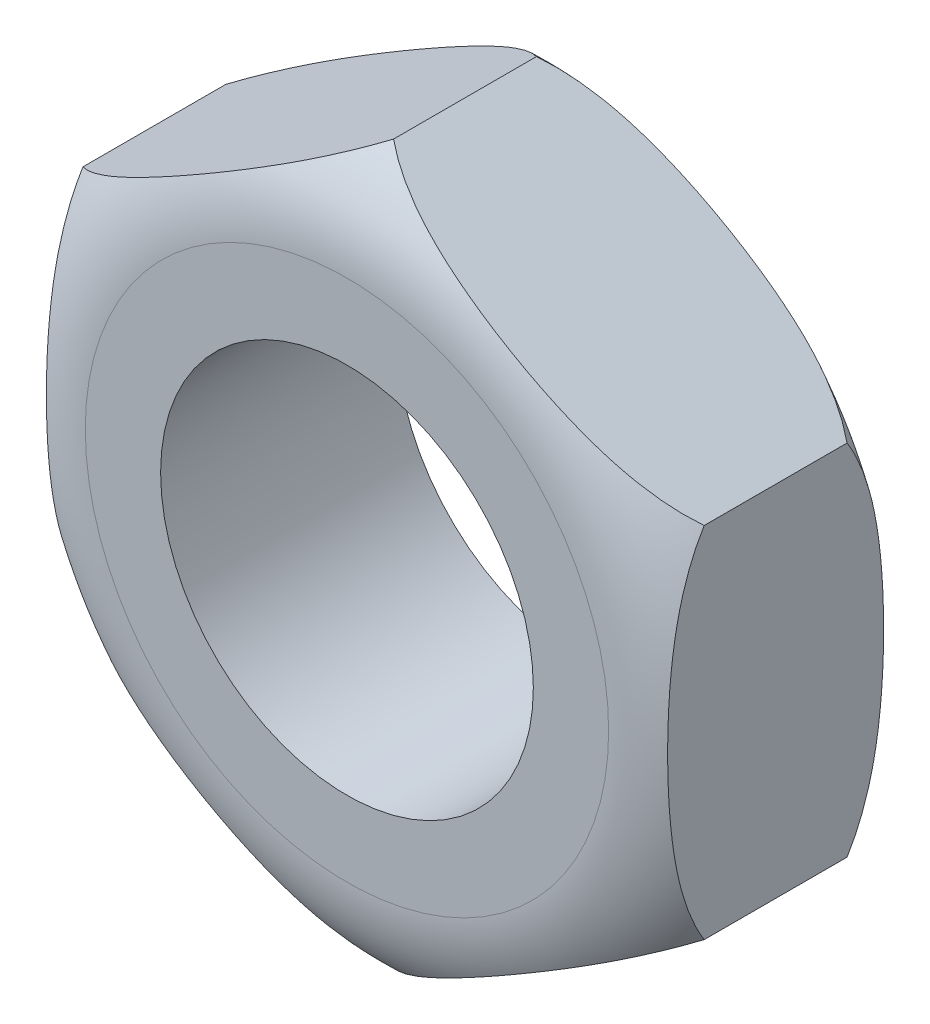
ISO-10303-21;
HEADER;
FILE_DESCRIPTION(('STEP AP214'),'2;1');
FILE_NAME('part.step','',(''),(''),'','','');
FILE_SCHEMA(('AUTOMOTIVE_DESIGN { 1 0 10303 214 1 1 1 1 }'));
ENDSEC;
DATA;
#1=APPLICATION_CONTEXT('core data for automotive mechanical design processes');
#2=APPLICATION_PROTOCOL_DEFINITION('international standard','automotive_design',2000,#1);
#3=PRODUCT_CONTEXT('',#1,'mechanical');
#4=PRODUCT('Part','Part','',(#3));
#5=PRODUCT_RELATED_PRODUCT_CATEGORY('part','',(#4));
#6=PRODUCT_DEFINITION_FORMATION('','',#4);
#7=PRODUCT_DEFINITION_CONTEXT('part definition',#1,'design');
#8=PRODUCT_DEFINITION('design','',#6,#7);
#9=PRODUCT_DEFINITION_SHAPE('','',#8);
#10=(LENGTH_UNIT() NAMED_UNIT(*) SI_UNIT(.MILLI.,.METRE.));
#11=(NAMED_UNIT(*) PLANE_ANGLE_UNIT() SI_UNIT($,.RADIAN.));
#12=(NAMED_UNIT(*) SI_UNIT($,.STERADIAN.) SOLID_ANGLE_UNIT());
#13=UNCERTAINTY_MEASURE_WITH_UNIT(LENGTH_MEASURE(1.E-05),#10,'distance_accuracy_value','');
#14=(GEOMETRIC_REPRESENTATION_CONTEXT(3) GLOBAL_UNCERTAINTY_ASSIGNED_CONTEXT((#13)) GLOBAL_UNIT_ASSIGNED_CONTEXT((#10,
#11,#12)) REPRESENTATION_CONTEXT('',''));
#15=CARTESIAN_POINT('',(0.,0.,0.));
#16=DIRECTION('',(0.,0.,1.));
#17=DIRECTION('',(1.,0.,0.));
#18=AXIS2_PLACEMENT_3D('',#15,#16,#17);
#19=CARTESIAN_POINT('',(4.99999999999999,2.88675134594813,3.8));
#20=DIRECTION('',(-0.5,-0.866025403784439,0.));
#21=DIRECTION('',(0.866025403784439,-0.5,0.));
#22=AXIS2_PLACEMENT_3D('',#19,#20,#21);
#23=PLANE('',#22);
#24=DIRECTION('',(0.,0.,-1.));
#25=VECTOR('',#24,1.);
#26=CARTESIAN_POINT('',(4.99999999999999,2.88675134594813,3.8));
#27=LINE('',#26,#25);
#28=CARTESIAN_POINT('',(4.99999999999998,2.88675134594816,3.05));
#29=VERTEX_POINT('',#28);
#30=CARTESIAN_POINT('',(4.99999999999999,2.88675134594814,0.750000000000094));
#31=VERTEX_POINT('',#30);
#32=EDGE_CURVE('E104',#29,#31,#27,.T.);
#33=ORIENTED_EDGE('',*,*,#32,.T.);
#34=CARTESIAN_POINT('',(5.00019999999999,2.8866358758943,0.750144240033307));
#35=CARTESIAN_POINT('',(4.93729772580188,2.92295252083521,0.704811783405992));
#36=CARTESIAN_POINT('',(4.87244419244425,2.96039572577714,0.663325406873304));
#37=CARTESIAN_POINT('',(4.7399369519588,3.03689881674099,0.587310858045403));
#38=CARTESIAN_POINT('',(4.67229081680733,3.07595433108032,0.552765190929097));
#39=CARTESIAN_POINT('',(4.53577934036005,3.15476926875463,0.49004698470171));
#40=CARTESIAN_POINT('',(4.46693777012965,3.19451496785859,0.461804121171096));
#41=CARTESIAN_POINT('',(4.32780877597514,3.27484113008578,0.410404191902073));
#42=CARTESIAN_POINT('',(4.25752042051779,3.31542213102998,0.387250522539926));
#43=CARTESIAN_POINT('',(4.09242506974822,3.41073997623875,0.338383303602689));
#44=CARTESIAN_POINT('',(3.99724085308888,3.46569460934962,0.314380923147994));
#45=CARTESIAN_POINT('',(3.80581203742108,3.57621608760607,0.272770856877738));
#46=CARTESIAN_POINT('',(3.70956694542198,3.63178321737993,0.255166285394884));
#47=CARTESIAN_POINT('',(3.51630813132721,3.74336124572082,0.225167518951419));
#48=CARTESIAN_POINT('',(3.41929334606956,3.7993727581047,0.212782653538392));
#49=CARTESIAN_POINT('',(3.22494659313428,3.91157890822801,0.192357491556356));
#50=CARTESIAN_POINT('',(3.12761467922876,3.9677735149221,0.18431649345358));
#51=CARTESIAN_POINT('',(2.93131850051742,4.08110516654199,0.17184045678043));
#52=CARTESIAN_POINT('',(2.83235164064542,4.13824370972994,0.167461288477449));
#53=CARTESIAN_POINT('',(2.63434465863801,4.25256309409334,0.162131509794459));
#54=CARTESIAN_POINT('',(2.53530453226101,4.30974393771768,0.161181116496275));
#55=CARTESIAN_POINT('',(2.33736372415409,4.42402511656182,0.162623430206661));
#56=CARTESIAN_POINT('',(2.23846302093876,4.48112546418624,0.165012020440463));
#57=CARTESIAN_POINT('',(2.04078137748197,4.59525701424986,0.17333724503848));
#58=CARTESIAN_POINT('',(1.94200042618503,4.65228822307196,0.179273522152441));
#59=CARTESIAN_POINT('',(1.73185589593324,4.77361522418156,0.196228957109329));
#60=CARTESIAN_POINT('',(1.62052479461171,4.83789226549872,0.207808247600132));
#61=CARTESIAN_POINT('',(1.39843626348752,4.9661151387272,0.237306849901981));
#62=CARTESIAN_POINT('',(1.28767903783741,5.03006085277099,0.255228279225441));
#63=CARTESIAN_POINT('',(1.06874025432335,5.15646521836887,0.298765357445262));
#64=CARTESIAN_POINT('',(0.960543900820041,5.21893241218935,0.324278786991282));
#65=CARTESIAN_POINT('',(0.746261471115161,5.34264843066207,0.385057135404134));
#66=CARTESIAN_POINT('',(0.64017375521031,5.40389820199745,0.420314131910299));
#67=CARTESIAN_POINT('',(0.442992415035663,5.51774090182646,0.498460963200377));
#68=CARTESIAN_POINT('',(0.351533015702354,5.57054501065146,0.54008473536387));
#69=CARTESIAN_POINT('',(0.217247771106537,5.64807463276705,0.61144068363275));
#70=CARTESIAN_POINT('',(0.17271159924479,5.6737876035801,0.636892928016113));
#71=CARTESIAN_POINT('',(0.0850818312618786,5.72438067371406,0.691030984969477));
#72=CARTESIAN_POINT('',(0.0419898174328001,5.7492598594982,0.719720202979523));
#73=CARTESIAN_POINT('',(-0.00020000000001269,5.7736181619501,0.750144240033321));
#74=B_SPLINE_CURVE_WITH_KNOTS('',3,(#34,#35,#36,#37,#38,#39,#40,#41,#42,#43,#44,#45,#46,#47,#48,
#49,#50,#51,#52,#53,#54,#55,#56,#57,#58,#59,#60,#61,#62,#63,#64,#65,#66,#67,#68,#69,#70,#71,#72,
#73),.UNSPECIFIED.,.F.,.F.,(4,2,2,2,2,2,2,2,2,2,2,2,2,2,2,2,2,2,2,4),(0.,0.256561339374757,
0.512467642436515,0.765357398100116,1.01841541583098,1.35566540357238,1.69307933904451,
2.03109382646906,2.36905370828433,2.71208049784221,3.05512900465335,3.39775492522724,
3.74034634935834,4.12744380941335,4.51467063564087,4.89690310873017,5.27882570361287,
5.61874076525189,5.79077638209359,5.96299470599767),.UNSPECIFIED.);
#75=CARTESIAN_POINT('',(0.,5.77350269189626,0.749999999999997));
#76=VERTEX_POINT('',#75);
#77=EDGE_CURVE('E39',#31,#76,#74,.T.);
#78=ORIENTED_EDGE('',*,*,#77,.T.);
#79=DIRECTION('',(0.,0.,-1.));
#80=VECTOR('',#79,1.);
#81=CARTESIAN_POINT('',(0.,5.77350269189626,3.8));
#82=LINE('',#81,#80);
#83=CARTESIAN_POINT('',(0.,5.77350269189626,3.05));
#84=VERTEX_POINT('',#83);
#85=EDGE_CURVE('E11',#84,#76,#82,.T.);
#86=ORIENTED_EDGE('',*,*,#85,.F.);
#87=CARTESIAN_POINT('',(-0.00020000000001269,5.7736181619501,3.04985575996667));
#88=CARTESIAN_POINT('',(0.0627022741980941,5.73730151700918,3.095188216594));
#89=CARTESIAN_POINT('',(0.127555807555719,5.69985831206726,3.13667459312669));
#90=CARTESIAN_POINT('',(0.260063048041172,5.62335522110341,3.21268914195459));
#91=CARTESIAN_POINT('',(0.32770918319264,5.58429970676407,3.2472348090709));
#92=CARTESIAN_POINT('',(0.464220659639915,5.50548476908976,3.30995301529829));
#93=CARTESIAN_POINT('',(0.533062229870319,5.4657390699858,3.33819587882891));
#94=CARTESIAN_POINT('',(0.672191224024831,5.38541290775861,3.38959580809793));
#95=CARTESIAN_POINT('',(0.742479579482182,5.34483190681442,3.41274947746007));
#96=CARTESIAN_POINT('',(0.907574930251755,5.24951406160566,3.4616166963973));
#97=CARTESIAN_POINT('',(1.00275914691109,5.19455942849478,3.48561907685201));
#98=CARTESIAN_POINT('',(1.19418796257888,5.08403795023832,3.52722914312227));
#99=CARTESIAN_POINT('',(1.29043305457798,5.02847082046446,3.54483371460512));
#100=CARTESIAN_POINT('',(1.48369186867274,4.91689279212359,3.57483248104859));
#101=CARTESIAN_POINT('',(1.5807066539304,4.8608812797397,3.58721734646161));
#102=CARTESIAN_POINT('',(1.77505340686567,4.74867512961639,3.60764250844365));
#103=CARTESIAN_POINT('',(1.87238532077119,4.6924805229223,3.61568350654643));
#104=CARTESIAN_POINT('',(2.06868149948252,4.57914887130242,3.62815954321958));
#105=CARTESIAN_POINT('',(2.16764835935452,4.52201032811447,3.63253871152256));
#106=CARTESIAN_POINT('',(2.36565534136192,4.40769094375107,3.63786849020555));
#107=CARTESIAN_POINT('',(2.46469546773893,4.35051010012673,3.63881888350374));
#108=CARTESIAN_POINT('',(2.66263627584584,4.23622892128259,3.63737656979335));
#109=CARTESIAN_POINT('',(2.76153697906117,4.17912857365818,3.63498797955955));
#110=CARTESIAN_POINT('',(2.95921862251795,4.06499702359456,3.62666275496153));
#111=CARTESIAN_POINT('',(3.05799957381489,4.00796581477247,3.62072647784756));
#112=CARTESIAN_POINT('',(3.26814410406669,3.88663881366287,3.60377104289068));
#113=CARTESIAN_POINT('',(3.37947520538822,3.8223617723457,3.59219175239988));
#114=CARTESIAN_POINT('',(3.60156373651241,3.69413889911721,3.56269315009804));
#115=CARTESIAN_POINT('',(3.71232096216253,3.63019318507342,3.54477172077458));
#116=CARTESIAN_POINT('',(3.93125974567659,3.50378881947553,3.50123464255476));
#117=CARTESIAN_POINT('',(4.03945609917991,3.44132162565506,3.47572121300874));
#118=CARTESIAN_POINT('',(4.25373852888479,3.31760560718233,3.41494286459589));
#119=CARTESIAN_POINT('',(4.35982624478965,3.25635583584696,3.37968586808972));
#120=CARTESIAN_POINT('',(4.55700758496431,3.14251313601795,3.30153903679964));
#121=CARTESIAN_POINT('',(4.64846698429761,3.08970902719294,3.25991526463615));
#122=CARTESIAN_POINT('',(4.78275222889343,3.01217940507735,3.18855931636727));
#123=CARTESIAN_POINT('',(4.82728840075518,2.98646643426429,3.16310707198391));
#124=CARTESIAN_POINT('',(4.9149181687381,2.93587336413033,3.10896901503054));
#125=CARTESIAN_POINT('',(4.95801018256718,2.91099417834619,3.0802797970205));
#126=CARTESIAN_POINT('',(5.00019999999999,2.88663587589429,3.04985575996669));
#127=B_SPLINE_CURVE_WITH_KNOTS('',3,(#87,#88,#89,#90,#91,#92,#93,#94,#95,#96,#97,#98,#99,#100,
#101,#102,#103,#104,#105,#106,#107,#108,#109,#110,#111,#112,#113,#114,#115,#116,#117,#118,#119,
#120,#121,#122,#123,#124,#125,#126),.UNSPECIFIED.,.F.,.F.,(4,2,2,2,2,2,2,2,2,2,2,2,2,2,2,2,2,2,
2,4),(0.,0.256561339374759,0.512467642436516,0.765357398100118,1.01841541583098,
1.35566540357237,1.6930793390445,2.03109382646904,2.36905370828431,2.71208049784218,
3.05512900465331,3.3977549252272,3.74034634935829,4.12744380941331,4.51467063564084,
4.89690310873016,5.27882570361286,5.6187407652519,5.7907763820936,5.96299470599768),.UNSPECIFIED.);
#128=EDGE_CURVE('E113',#84,#29,#127,.T.);
#129=ORIENTED_EDGE('',*,*,#128,.T.);
#130=EDGE_LOOP('',(#33,#78,#86,#129));
#131=FACE_BOUND('',#130,.T.);
#132=ADVANCED_FACE('F24',(#131),#23,.F.);
#133=CARTESIAN_POINT('',(0.,5.77350269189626,3.8));
#134=DIRECTION('',(0.5,-0.866025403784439,0.));
#135=DIRECTION('',(0.866025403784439,0.5,0.));
#136=AXIS2_PLACEMENT_3D('',#133,#134,#135);
#137=PLANE('',#136);
#138=ORIENTED_EDGE('',*,*,#85,.T.);
#139=CARTESIAN_POINT('',(0.000199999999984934,5.7736181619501,0.750144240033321));
#140=CARTESIAN_POINT('',(-0.0627022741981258,5.73730151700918,0.704811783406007));
#141=CARTESIAN_POINT('',(-0.127555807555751,5.69985831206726,0.663325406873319));
#142=CARTESIAN_POINT('',(-0.260063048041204,5.62335522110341,0.587310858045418));
#143=CARTESIAN_POINT('',(-0.327709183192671,5.58429970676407,0.552765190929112));
#144=CARTESIAN_POINT('',(-0.464220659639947,5.50548476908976,0.490046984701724));
#145=CARTESIAN_POINT('',(-0.533062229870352,5.4657390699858,0.46180412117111));
#146=CARTESIAN_POINT('',(-0.67219122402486,5.38541290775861,0.410404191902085));
#147=CARTESIAN_POINT('',(-0.742479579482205,5.34483190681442,0.387250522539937));
#148=CARTESIAN_POINT('',(-0.907574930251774,5.24951406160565,0.338383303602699));
#149=CARTESIAN_POINT('',(-1.00275914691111,5.19455942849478,0.314380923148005));
#150=CARTESIAN_POINT('',(-1.19418796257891,5.08403795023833,0.27277085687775));
#151=CARTESIAN_POINT('',(-1.29043305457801,5.02847082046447,0.255166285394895));
#152=CARTESIAN_POINT('',(-1.48369186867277,4.91689279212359,0.22516751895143));
#153=CARTESIAN_POINT('',(-1.58070665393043,4.86088127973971,0.212782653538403));
#154=CARTESIAN_POINT('',(-1.7750534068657,4.7486751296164,0.192357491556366));
#155=CARTESIAN_POINT('',(-1.87238532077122,4.69248052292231,0.18431649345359));
#156=CARTESIAN_POINT('',(-2.06868149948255,4.57914887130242,0.171840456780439));
#157=CARTESIAN_POINT('',(-2.16764835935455,4.52201032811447,0.167461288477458));
#158=CARTESIAN_POINT('',(-2.36565534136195,4.40769094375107,0.162131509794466));
#159=CARTESIAN_POINT('',(-2.46469546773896,4.35051010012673,0.161181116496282));
#160=CARTESIAN_POINT('',(-2.66263627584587,4.2362289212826,0.162623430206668));
#161=CARTESIAN_POINT('',(-2.7615369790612,4.17912857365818,0.165012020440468));
#162=CARTESIAN_POINT('',(-2.95921862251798,4.06499702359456,0.173337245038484));
#163=CARTESIAN_POINT('',(-3.05799957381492,4.00796581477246,0.179273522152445));
#164=CARTESIAN_POINT('',(-3.26814410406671,3.88663881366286,0.196228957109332));
#165=CARTESIAN_POINT('',(-3.37947520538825,3.8223617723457,0.207808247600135));
#166=CARTESIAN_POINT('',(-3.60156373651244,3.69413889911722,0.237306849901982));
#167=CARTESIAN_POINT('',(-3.71232096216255,3.63019318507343,0.255228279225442));
#168=CARTESIAN_POINT('',(-3.93125974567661,3.50378881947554,0.298765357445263));
#169=CARTESIAN_POINT('',(-4.03945609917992,3.44132162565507,0.324278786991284));
#170=CARTESIAN_POINT('',(-4.25373852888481,3.31760560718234,0.385057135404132));
#171=CARTESIAN_POINT('',(-4.35982624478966,3.25635583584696,0.420314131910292));
#172=CARTESIAN_POINT('',(-4.55700758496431,3.14251313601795,0.498460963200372));
#173=CARTESIAN_POINT('',(-4.64846698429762,3.08970902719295,0.540084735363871));
#174=CARTESIAN_POINT('',(-4.78275222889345,3.01217940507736,0.611440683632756));
#175=CARTESIAN_POINT('',(-4.8272884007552,2.9864664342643,0.636892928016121));
#176=CARTESIAN_POINT('',(-4.91491816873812,2.93587336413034,0.691030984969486));
#177=CARTESIAN_POINT('',(-4.9580101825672,2.91099417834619,0.719720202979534));
#178=CARTESIAN_POINT('',(-5.00020000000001,2.88663587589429,0.750144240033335));
#179=B_SPLINE_CURVE_WITH_KNOTS('',3,(#139,#140,#141,#142,#143,#144,#145,#146,#147,#148,#149,
#150,#151,#152,#153,#154,#155,#156,#157,#158,#159,#160,#161,#162,#163,#164,#165,#166,#167,#168,
#169,#170,#171,#172,#173,#174,#175,#176,#177,#178),.UNSPECIFIED.,.F.,.F.,(4,2,2,2,2,2,2,2,2,2,2,
2,2,2,2,2,2,2,2,4),(0.,0.256561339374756,0.512467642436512,0.765357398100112,1.01841541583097,
1.35566540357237,1.69307933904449,2.03109382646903,2.3690537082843,2.71208049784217,
3.05512900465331,3.39775492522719,3.74034634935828,4.1274438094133,4.51467063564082,
4.89690310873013,5.27882570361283,5.61874076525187,5.79077638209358,5.96299470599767),.UNSPECIFIED.);
#180=CARTESIAN_POINT('',(-5.00000000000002,2.88675134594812,0.750000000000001));
#181=VERTEX_POINT('',#180);
#182=EDGE_CURVE('E78',#76,#181,#179,.T.);
#183=ORIENTED_EDGE('',*,*,#182,.T.);
#184=DIRECTION('',(0.,0.,-1.));
#185=VECTOR('',#184,1.);
#186=CARTESIAN_POINT('',(-5.00000000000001,2.88675134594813,3.8));
#187=LINE('',#186,#185);
#188=CARTESIAN_POINT('',(-5.00000000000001,2.88675134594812,3.05));
#189=VERTEX_POINT('',#188);
#190=EDGE_CURVE('E32',#189,#181,#187,.T.);
#191=ORIENTED_EDGE('',*,*,#190,.F.);
#192=CARTESIAN_POINT('',(-5.00020000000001,2.8866358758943,3.04985575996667));
#193=CARTESIAN_POINT('',(-4.9372977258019,2.92295252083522,3.09518821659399));
#194=CARTESIAN_POINT('',(-4.87244419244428,2.96039572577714,3.13667459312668));
#195=CARTESIAN_POINT('',(-4.73993695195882,3.03689881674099,3.21268914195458));
#196=CARTESIAN_POINT('',(-4.67229081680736,3.07595433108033,3.24723480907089));
#197=CARTESIAN_POINT('',(-4.53577934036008,3.15476926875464,3.30995301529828));
#198=CARTESIAN_POINT('',(-4.46693777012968,3.1945149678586,3.33819587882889));
#199=CARTESIAN_POINT('',(-4.32780877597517,3.27484113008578,3.38959580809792));
#200=CARTESIAN_POINT('',(-4.25752042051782,3.31542213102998,3.41274947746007));
#201=CARTESIAN_POINT('',(-4.09242506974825,3.41073997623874,3.46161669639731));
#202=CARTESIAN_POINT('',(-3.99724085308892,3.46569460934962,3.485619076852));
#203=CARTESIAN_POINT('',(-3.80581203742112,3.57621608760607,3.52722914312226));
#204=CARTESIAN_POINT('',(-3.70956694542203,3.63178321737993,3.54483371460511));
#205=CARTESIAN_POINT('',(-3.51630813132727,3.7433612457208,3.57483248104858));
#206=CARTESIAN_POINT('',(-3.41929334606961,3.79937275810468,3.58721734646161));
#207=CARTESIAN_POINT('',(-3.22494659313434,3.91157890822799,3.60764250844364));
#208=CARTESIAN_POINT('',(-3.12761467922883,3.96777351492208,3.61568350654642));
#209=CARTESIAN_POINT('',(-2.9313185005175,4.08110516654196,3.62815954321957));
#210=CARTESIAN_POINT('',(-2.8323516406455,4.13824370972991,3.63253871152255));
#211=CARTESIAN_POINT('',(-2.63434465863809,4.25256309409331,3.63786849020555));
#212=CARTESIAN_POINT('',(-2.53530453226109,4.30974393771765,3.63881888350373));
#213=CARTESIAN_POINT('',(-2.33736372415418,4.42402511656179,3.63737656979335));
#214=CARTESIAN_POINT('',(-2.23846302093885,4.4811254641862,3.63498797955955));
#215=CARTESIAN_POINT('',(-2.04078137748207,4.59525701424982,3.62666275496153));
#216=CARTESIAN_POINT('',(-1.94200042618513,4.65228822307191,3.62072647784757));
#217=CARTESIAN_POINT('',(-1.73185589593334,4.77361522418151,3.60377104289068));
#218=CARTESIAN_POINT('',(-1.62052479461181,4.83789226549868,3.59219175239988));
#219=CARTESIAN_POINT('',(-1.39843626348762,4.96611513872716,3.56269315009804));
#220=CARTESIAN_POINT('',(-1.2876790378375,5.03006085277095,3.54477172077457));
#221=CARTESIAN_POINT('',(-1.06874025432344,5.15646521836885,3.50123464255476));
#222=CARTESIAN_POINT('',(-0.960543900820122,5.21893241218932,3.47572121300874));
#223=CARTESIAN_POINT('',(-0.746261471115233,5.34264843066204,3.41494286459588));
#224=CARTESIAN_POINT('',(-0.640173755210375,5.40389820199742,3.37968586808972));
#225=CARTESIAN_POINT('',(-0.442992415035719,5.51774090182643,3.30153903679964));
#226=CARTESIAN_POINT('',(-0.351533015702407,5.57054501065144,3.25991526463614));
#227=CARTESIAN_POINT('',(-0.21724777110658,5.64807463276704,3.18855931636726));
#228=CARTESIAN_POINT('',(-0.17271159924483,5.6737876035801,3.1631070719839));
#229=CARTESIAN_POINT('',(-0.0850818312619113,5.72438067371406,3.10896901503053));
#230=CARTESIAN_POINT('',(-0.0419898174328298,5.7492598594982,3.08027979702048));
#231=CARTESIAN_POINT('',(0.000199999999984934,5.7736181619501,3.04985575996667));
#232=B_SPLINE_CURVE_WITH_KNOTS('',3,(#192,#193,#194,#195,#196,#197,#198,#199,#200,#201,#202,
#203,#204,#205,#206,#207,#208,#209,#210,#211,#212,#213,#214,#215,#216,#217,#218,#219,#220,#221,
#222,#223,#224,#225,#226,#227,#228,#229,#230,#231),.UNSPECIFIED.,.F.,.F.,(4,2,2,2,2,2,2,2,2,2,2,
2,2,2,2,2,2,2,2,4),(0.,0.256561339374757,0.512467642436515,0.765357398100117,1.01841541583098,
1.35566540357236,1.69307933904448,2.03109382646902,2.36905370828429,2.71208049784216,
3.05512900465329,3.39775492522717,3.74034634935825,4.12744380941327,4.5146706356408,
4.89690310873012,5.27882570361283,5.61874076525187,5.79077638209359,5.96299470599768),.UNSPECIFIED.);
#233=EDGE_CURVE('E120',#189,#84,#232,.T.);
#234=ORIENTED_EDGE('',*,*,#233,.T.);
#235=EDGE_LOOP('',(#138,#183,#191,#234));
#236=FACE_BOUND('',#235,.T.);
#237=ADVANCED_FACE('F88',(#236),#137,.F.);
#238=CARTESIAN_POINT('',(-5.00000000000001,2.88675134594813,3.8));
#239=DIRECTION('',(1.,0.,0.));
#240=DIRECTION('',(0.,0.,-1.));
#241=AXIS2_PLACEMENT_3D('',#238,#239,#240);
#242=PLANE('',#241);
#243=ORIENTED_EDGE('',*,*,#190,.T.);
#244=CARTESIAN_POINT('',(-5.00000000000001,0.,0.161670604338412));
#245=CARTESIAN_POINT('',(-5.00000000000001,-0.174653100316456,0.16166457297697));
#246=CARTESIAN_POINT('',(-5.00000000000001,-0.34931140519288,0.165522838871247));
#247=CARTESIAN_POINT('',(-5.00000000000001,-0.698368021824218,0.181756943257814));
#248=CARTESIAN_POINT('',(-5.00000000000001,-0.872766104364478,0.194138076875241));
#249=CARTESIAN_POINT('',(-5.00000000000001,-1.22017018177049,0.229810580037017));
#250=CARTESIAN_POINT('',(-5.00000000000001,-1.39317815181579,0.253081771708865));
#251=CARTESIAN_POINT('',(-5.00000000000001,-1.73649391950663,0.314438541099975));
#252=CARTESIAN_POINT('',(-5.00000000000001,-1.90680527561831,0.352502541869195));
#253=CARTESIAN_POINT('',(-5.00000000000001,-2.15894464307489,0.425071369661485));
#254=CARTESIAN_POINT('',(-5.00000000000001,-2.2429170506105,0.452043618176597));
#255=CARTESIAN_POINT('',(-5.00000000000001,-2.40867037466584,0.512007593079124));
#256=CARTESIAN_POINT('',(-5.00000000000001,-2.49045058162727,0.545001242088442));
#257=CARTESIAN_POINT('',(-5.00000000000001,-2.73041456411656,0.654070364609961));
#258=CARTESIAN_POINT('',(-5.00000000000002,-2.88438106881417,0.740536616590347));
#259=CARTESIAN_POINT('',(-5.00000000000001,-3.09690003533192,0.895892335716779));
#260=CARTESIAN_POINT('',(-5.00000000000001,-3.16477811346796,0.952083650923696));
#261=CARTESIAN_POINT('',(-5.00000000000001,-3.29197233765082,1.07366189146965));
#262=CARTESIAN_POINT('',(-5.00000000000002,-3.3512845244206,1.13905304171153));
#263=CARTESIAN_POINT('',(-5.00000000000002,-3.45884681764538,1.27964997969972));
#264=CARTESIAN_POINT('',(-5.00000000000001,-3.50697000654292,1.35495449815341));
#265=CARTESIAN_POINT('',(-5.00000000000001,-3.58773866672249,1.5134757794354));
#266=CARTESIAN_POINT('',(-5.00000000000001,-3.62040828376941,1.59667995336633));
#267=CARTESIAN_POINT('',(-5.00000000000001,-3.66444801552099,1.75793267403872));
#268=CARTESIAN_POINT('',(-5.00000000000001,-3.67789505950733,1.83541113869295));
#269=CARTESIAN_POINT('',(-5.00000000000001,-3.68927983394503,1.99149564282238));
#270=CARTESIAN_POINT('',(-5.00000000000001,-3.68722685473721,2.07010097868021));
#271=CARTESIAN_POINT('',(-5.00000000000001,-3.66917114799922,2.2146706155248));
#272=CARTESIAN_POINT('',(-5.00000000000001,-3.65512026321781,2.28089004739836));
#273=CARTESIAN_POINT('',(-5.00000000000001,-3.61656028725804,2.41017627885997));
#274=CARTESIAN_POINT('',(-5.00000000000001,-3.59205179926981,2.4732432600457));
#275=CARTESIAN_POINT('',(-5.00000000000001,-3.5326269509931,2.59769249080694));
#276=CARTESIAN_POINT('',(-5.00000000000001,-3.49729589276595,2.65887480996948));
#277=CARTESIAN_POINT('',(-5.00000000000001,-3.41841814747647,2.7756678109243));
#278=CARTESIAN_POINT('',(-5.00000000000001,-3.37486564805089,2.8312745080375));
#279=CARTESIAN_POINT('',(-5.00000000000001,-3.25454045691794,2.96658165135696));
#280=CARTESIAN_POINT('',(-5.00000000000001,-3.17295748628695,3.04200877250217));
#281=CARTESIAN_POINT('',(-5.00000000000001,-2.99892334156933,3.17896176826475));
#282=CARTESIAN_POINT('',(-5.00000000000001,-2.90645172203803,3.24046083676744));
#283=CARTESIAN_POINT('',(-5.00000000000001,-2.73313767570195,3.34030501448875));
#284=CARTESIAN_POINT('',(-5.00000000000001,-2.65352044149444,3.38082738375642));
#285=CARTESIAN_POINT('',(-5.00000000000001,-2.49102526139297,3.45478905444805));
#286=CARTESIAN_POINT('',(-5.00000000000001,-2.40814507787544,3.48822339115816));
#287=CARTESIAN_POINT('',(-5.00000000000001,-2.23990476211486,3.5490043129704));
#288=CARTESIAN_POINT('',(-5.00000000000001,-2.15453736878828,3.57633051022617));
#289=CARTESIAN_POINT('',(-5.00000000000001,-1.98232158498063,3.62561977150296));
#290=CARTESIAN_POINT('',(-5.00000000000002,-1.89547371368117,3.64758467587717));
#291=CARTESIAN_POINT('',(-5.00000000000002,-1.68840753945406,3.69424224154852));
#292=CARTESIAN_POINT('',(-5.00000000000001,-1.56774134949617,3.71693293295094));
#293=CARTESIAN_POINT('',(-5.00000000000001,-1.32529714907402,3.75546038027));
#294=CARTESIAN_POINT('',(-5.00000000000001,-1.20351860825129,3.77129367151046));
#295=CARTESIAN_POINT('',(-5.00000000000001,-0.959102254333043,3.79745272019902));
#296=CARTESIAN_POINT('',(-5.00000000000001,-0.836463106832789,3.80776568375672));
#297=CARTESIAN_POINT('',(-5.00000000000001,-0.590916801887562,3.82378659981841));
#298=CARTESIAN_POINT('',(-5.00000000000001,-0.468009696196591,3.82949537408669));
#299=CARTESIAN_POINT('',(-5.00000000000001,-0.221487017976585,3.83689865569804));
#300=CARTESIAN_POINT('',(-5.00000000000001,-0.0978708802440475,3.83857373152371));
#301=CARTESIAN_POINT('',(-5.00000000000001,0.149364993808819,3.83802824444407));
#302=CARTESIAN_POINT('',(-5.00000000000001,0.272984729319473,3.83580730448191));
#303=CARTESIAN_POINT('',(-5.00000000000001,0.519875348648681,3.82724475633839));
#304=CARTESIAN_POINT('',(-5.00000000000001,0.643146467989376,3.82091017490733));
#305=CARTESIAN_POINT('',(-5.00000000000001,0.88933986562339,3.80349749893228));
#306=CARTESIAN_POINT('',(-5.00000000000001,1.01226220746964,3.79242033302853));
#307=CARTESIAN_POINT('',(-5.00000000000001,1.25757350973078,3.76448706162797));
#308=CARTESIAN_POINT('',(-5.00000000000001,1.37996192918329,3.74762606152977));
#309=CARTESIAN_POINT('',(-5.00000000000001,1.62362946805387,3.70670252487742));
#310=CARTESIAN_POINT('',(-5.00000000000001,1.74490797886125,3.68263625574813));
#311=CARTESIAN_POINT('',(-5.00000000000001,1.98434881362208,3.6257547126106));
#312=CARTESIAN_POINT('',(-5.00000000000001,2.10252892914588,3.59301612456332));
#313=CARTESIAN_POINT('',(-5.00000000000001,2.33525027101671,3.51663450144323));
#314=CARTESIAN_POINT('',(-5.00000000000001,2.44979598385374,3.47300555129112));
#315=CARTESIAN_POINT('',(-5.00000000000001,2.65555896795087,3.38031572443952));
#316=CARTESIAN_POINT('',(-5.00000000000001,2.74762583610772,3.33316713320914));
#317=CARTESIAN_POINT('',(-5.00000000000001,2.92557749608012,3.22781965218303));
#318=CARTESIAN_POINT('',(-5.00000000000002,3.01145003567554,3.16959964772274));
#319=CARTESIAN_POINT('',(-5.00000000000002,3.17458387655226,3.04018694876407));
#320=CARTESIAN_POINT('',(-5.00000000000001,3.25173642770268,2.9688545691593));
#321=CARTESIAN_POINT('',(-5.00000000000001,3.39161540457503,2.8132398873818));
#322=CARTESIAN_POINT('',(-5.00000000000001,3.45438396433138,2.72899664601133));
#323=CARTESIAN_POINT('',(-5.00000000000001,3.54364700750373,2.57697657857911));
#324=CARTESIAN_POINT('',(-5.00000000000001,3.5753496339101,2.51225309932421));
#325=CARTESIAN_POINT('',(-5.00000000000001,3.62763470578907,2.37842887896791));
#326=CARTESIAN_POINT('',(-5.00000000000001,3.64822362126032,2.30933071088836));
#327=CARTESIAN_POINT('',(-5.00000000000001,3.676954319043,2.16823233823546));
#328=CARTESIAN_POINT('',(-5.00000000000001,3.68503895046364,2.09622034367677));
#329=CARTESIAN_POINT('',(-5.00000000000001,3.68796301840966,1.95192758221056));
#330=CARTESIAN_POINT('',(-5.00000000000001,3.68280414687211,1.87964685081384));
#331=CARTESIAN_POINT('',(-5.00000000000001,3.66046020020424,1.742178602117));
#332=CARTESIAN_POINT('',(-5.00000000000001,3.64413715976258,1.67684754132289));
#333=CARTESIAN_POINT('',(-5.00000000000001,3.60139390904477,1.54960513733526));
#334=CARTESIAN_POINT('',(-5.00000000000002,3.5749720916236,1.48769434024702));
#335=CARTESIAN_POINT('',(-5.00000000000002,3.51145087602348,1.36460452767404));
#336=CARTESIAN_POINT('',(-5.00000000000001,3.47377804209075,1.30372391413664));
#337=CARTESIAN_POINT('',(-5.00000000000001,3.39037961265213,1.18780021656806));
#338=CARTESIAN_POINT('',(-5.00000000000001,3.3446498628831,1.13276016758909));
#339=CARTESIAN_POINT('',(-5.00000000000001,3.2174097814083,0.997461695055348));
#340=CARTESIAN_POINT('',(-5.00000000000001,3.1308999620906,0.921899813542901));
#341=CARTESIAN_POINT('',(-5.00000000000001,2.94704072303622,0.785337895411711));
#342=CARTESIAN_POINT('',(-5.00000000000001,2.84966287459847,0.724377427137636));
#343=CARTESIAN_POINT('',(-5.00000000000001,2.66603942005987,0.62505073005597));
#344=CARTESIAN_POINT('',(-5.00000000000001,2.58089783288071,0.58459418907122));
#345=CARTESIAN_POINT('',(-5.00000000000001,2.40738396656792,0.511234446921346));
#346=CARTESIAN_POINT('',(-5.00000000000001,2.3190093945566,0.478336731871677));
#347=CARTESIAN_POINT('',(-5.00000000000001,2.14001920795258,0.419020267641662));
#348=CARTESIAN_POINT('',(-5.00000000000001,2.0494008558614,0.392609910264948));
#349=CARTESIAN_POINT('',(-5.00000000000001,1.86671793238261,0.345336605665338));
#350=CARTESIAN_POINT('',(-5.00000000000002,1.77465286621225,0.324475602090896));
#351=CARTESIAN_POINT('',(-5.00000000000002,1.54410142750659,0.278334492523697));
#352=CARTESIAN_POINT('',(-5.00000000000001,1.40504480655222,0.25592382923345));
#353=CARTESIAN_POINT('',(-5.00000000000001,1.12586375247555,0.219181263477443));
#354=CARTESIAN_POINT('',(-5.00000000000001,0.985738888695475,0.204852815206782));
#355=CARTESIAN_POINT('',(-5.00000000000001,0.704759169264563,0.182583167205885));
#356=CARTESIAN_POINT('',(-5.00000000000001,0.563903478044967,0.174652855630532));
#357=CARTESIAN_POINT('',(-5.00000000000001,0.282032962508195,0.164199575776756));
#358=CARTESIAN_POINT('',(-5.00000000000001,0.14101817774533,0.161675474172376));
#359=CARTESIAN_POINT('',(-5.00000000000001,0.,0.161670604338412));
#360=B_SPLINE_CURVE_WITH_KNOTS('',3,(#244,#245,#246,#247,#248,#249,#250,#251,#252,#253,#254,
#255,#256,#257,#258,#259,#260,#261,#262,#263,#264,#265,#266,#267,#268,#269,#270,#271,#272,#273,
#274,#275,#276,#277,#278,#279,#280,#281,#282,#283,#284,#285,#286,#287,#288,#289,#290,#291,#292,
#293,#294,#295,#296,#297,#298,#299,#300,#301,#302,#303,#304,#305,#306,#307,#308,#309,#310,#311,
#312,#313,#314,#315,#316,#317,#318,#319,#320,#321,#322,#323,#324,#325,#326,#327,#328,#329,#330,
#331,#332,#333,#334,#335,#336,#337,#338,#339,#340,#341,#342,#343,#344,#345,#346,#347,#348,#349,
#350,#351,#352,#353,#354,#355,#356,#357,#358,#359),.UNSPECIFIED.,.T.,.F.,(4,2,2,2,2,2,2,2,2,2,2,
2,2,2,2,2,2,2,2,2,2,2,2,2,2,2,2,2,2,2,2,2,2,2,2,2,2,2,2,2,2,2,2,2,2,2,2,2,2,2,2,2,2,2,2,2,2,4),
(0.,0.523922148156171,1.04817009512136,1.57145050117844,2.09397049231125,2.35833761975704,
2.62278930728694,3.14812988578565,3.41179403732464,3.67557967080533,3.94222549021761,
4.2084532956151,4.44290299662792,4.67721218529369,4.87938557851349,5.08154731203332,
5.29270722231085,5.50401698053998,5.83545076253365,6.16751710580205,6.43514896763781,
6.70296767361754,6.97166738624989,7.24027473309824,7.60835104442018,7.97661310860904,
8.34572500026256,8.71477099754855,9.08559127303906,9.45644743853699,9.8266717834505,
10.1968236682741,10.5672895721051,10.9379477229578,11.3054317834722,11.6724430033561,
11.9821397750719,12.2924332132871,12.6062470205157,12.9191294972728,13.1344768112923,
13.3496986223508,13.5659012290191,13.7820762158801,13.9832050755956,14.1843659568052,
14.3983541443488,14.6124529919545,14.955080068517,15.2986253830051,15.5810161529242,
15.8636112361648,16.1465699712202,16.4296276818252,16.8518433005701,17.2742392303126,
17.6973524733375,18.1203770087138),.UNSPECIFIED.);
#361=CARTESIAN_POINT('',(-5.00000000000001,-2.88675134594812,0.750000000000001));
#362=VERTEX_POINT('',#361);
#363=EDGE_CURVE('E75',#181,#362,#360,.T.);
#364=ORIENTED_EDGE('',*,*,#363,.T.);
#365=DIRECTION('',(0.,0.,-1.));
#366=VECTOR('',#365,1.);
#367=CARTESIAN_POINT('',(-5.00000000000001,-2.88675134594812,3.8));
#368=LINE('',#367,#366);
#369=CARTESIAN_POINT('',(-5.00000000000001,-2.88675134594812,3.05));
#370=VERTEX_POINT('',#369);
#371=EDGE_CURVE('E95',#370,#362,#368,.T.);
#372=ORIENTED_EDGE('',*,*,#371,.F.);
#373=CARTESIAN_POINT('',(-5.00000000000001,0.,3.63832939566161));
#374=CARTESIAN_POINT('',(-5.00000000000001,0.174653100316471,3.63833542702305));
#375=CARTESIAN_POINT('',(-5.00000000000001,0.349311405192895,3.63447716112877));
#376=CARTESIAN_POINT('',(-5.00000000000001,0.698368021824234,3.6182430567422));
#377=CARTESIAN_POINT('',(-5.00000000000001,0.872766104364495,3.60586192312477));
#378=CARTESIAN_POINT('',(-5.00000000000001,1.22017018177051,3.57018941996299));
#379=CARTESIAN_POINT('',(-5.00000000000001,1.3931781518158,3.54691822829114));
#380=CARTESIAN_POINT('',(-5.00000000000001,1.73649391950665,3.48556145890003));
#381=CARTESIAN_POINT('',(-5.00000000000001,1.90680527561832,3.44749745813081));
#382=CARTESIAN_POINT('',(-5.00000000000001,2.15894464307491,3.37492863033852));
#383=CARTESIAN_POINT('',(-5.00000000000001,2.24291705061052,3.34795638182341));
#384=CARTESIAN_POINT('',(-5.00000000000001,2.40867037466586,3.28799240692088));
#385=CARTESIAN_POINT('',(-5.00000000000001,2.49045058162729,3.25499875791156));
#386=CARTESIAN_POINT('',(-5.00000000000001,2.73041456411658,3.14592963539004));
#387=CARTESIAN_POINT('',(-5.00000000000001,2.88438106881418,3.05946338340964));
#388=CARTESIAN_POINT('',(-5.00000000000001,3.09690003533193,2.90410766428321));
#389=CARTESIAN_POINT('',(-5.00000000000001,3.16477811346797,2.8479163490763));
#390=CARTESIAN_POINT('',(-5.00000000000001,3.29197233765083,2.72633810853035));
#391=CARTESIAN_POINT('',(-5.00000000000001,3.35128452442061,2.66094695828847));
#392=CARTESIAN_POINT('',(-5.00000000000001,3.45884681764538,2.52035002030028));
#393=CARTESIAN_POINT('',(-5.00000000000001,3.50697000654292,2.44504550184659));
#394=CARTESIAN_POINT('',(-5.00000000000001,3.58773866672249,2.2865242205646));
#395=CARTESIAN_POINT('',(-5.00000000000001,3.6204082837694,2.20332004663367));
#396=CARTESIAN_POINT('',(-5.00000000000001,3.66444801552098,2.04206732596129));
#397=CARTESIAN_POINT('',(-5.00000000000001,3.67789505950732,1.96458886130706));
#398=CARTESIAN_POINT('',(-5.00000000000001,3.68927983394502,1.80850435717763));
#399=CARTESIAN_POINT('',(-5.00000000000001,3.68722685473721,1.72989902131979));
#400=CARTESIAN_POINT('',(-5.00000000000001,3.66917114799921,1.5853293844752));
#401=CARTESIAN_POINT('',(-5.00000000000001,3.6551202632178,1.51910995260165));
#402=CARTESIAN_POINT('',(-5.00000000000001,3.61656028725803,1.38982372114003));
#403=CARTESIAN_POINT('',(-5.00000000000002,3.5920517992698,1.32675673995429));
#404=CARTESIAN_POINT('',(-5.00000000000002,3.53262695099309,1.20230750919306));
#405=CARTESIAN_POINT('',(-5.00000000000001,3.49729589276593,1.14112519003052));
#406=CARTESIAN_POINT('',(-5.00000000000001,3.41841814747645,1.0243321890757));
#407=CARTESIAN_POINT('',(-5.00000000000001,3.37486564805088,0.968725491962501));
#408=CARTESIAN_POINT('',(-5.00000000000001,3.25454045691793,0.833418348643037));
#409=CARTESIAN_POINT('',(-5.00000000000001,3.17295748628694,0.757991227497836));
#410=CARTESIAN_POINT('',(-5.00000000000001,2.99892334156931,0.621038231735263));
#411=CARTESIAN_POINT('',(-5.00000000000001,2.90645172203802,0.559539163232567));
#412=CARTESIAN_POINT('',(-5.00000000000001,2.73313767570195,0.459694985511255));
#413=CARTESIAN_POINT('',(-5.00000000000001,2.65352044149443,0.419172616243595));
#414=CARTESIAN_POINT('',(-5.00000000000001,2.49102526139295,0.345210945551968));
#415=CARTESIAN_POINT('',(-5.00000000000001,2.40814507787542,0.311776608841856));
#416=CARTESIAN_POINT('',(-5.00000000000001,2.23990476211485,0.250995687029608));
#417=CARTESIAN_POINT('',(-5.00000000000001,2.15453736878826,0.223669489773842));
#418=CARTESIAN_POINT('',(-5.00000000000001,1.98232158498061,0.174380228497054));
#419=CARTESIAN_POINT('',(-5.00000000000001,1.89547371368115,0.152415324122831));
#420=CARTESIAN_POINT('',(-5.00000000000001,1.68840753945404,0.105757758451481));
#421=CARTESIAN_POINT('',(-5.00000000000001,1.56774134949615,0.0830670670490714));
#422=CARTESIAN_POINT('',(-5.00000000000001,1.32529714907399,0.0445396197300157));
#423=CARTESIAN_POINT('',(-5.00000000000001,1.20351860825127,0.0287063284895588));
#424=CARTESIAN_POINT('',(-5.00000000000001,0.959102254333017,0.00254727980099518));
#425=CARTESIAN_POINT('',(-5.00000000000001,0.836463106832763,-0.0077656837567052));
#426=CARTESIAN_POINT('',(-5.00000000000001,0.590916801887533,-0.0237865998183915));
#427=CARTESIAN_POINT('',(-5.00000000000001,0.468009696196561,-0.0294953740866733));
#428=CARTESIAN_POINT('',(-5.00000000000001,0.221487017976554,-0.0368986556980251));
#429=CARTESIAN_POINT('',(-5.00000000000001,0.0978708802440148,-0.0385737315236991));
#430=CARTESIAN_POINT('',(-5.00000000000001,-0.149364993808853,-0.0380282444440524));
#431=CARTESIAN_POINT('',(-5.00000000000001,-0.272984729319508,-0.035807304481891));
#432=CARTESIAN_POINT('',(-5.00000000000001,-0.519875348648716,-0.027244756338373));
#433=CARTESIAN_POINT('',(-5.00000000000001,-0.643146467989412,-0.0209101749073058));
#434=CARTESIAN_POINT('',(-5.00000000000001,-0.889339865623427,-0.00349749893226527));
#435=CARTESIAN_POINT('',(-5.00000000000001,-1.01226220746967,0.00757966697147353));
#436=CARTESIAN_POINT('',(-5.00000000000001,-1.25757350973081,0.0355129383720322));
#437=CARTESIAN_POINT('',(-5.00000000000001,-1.37996192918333,0.0523739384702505));
#438=CARTESIAN_POINT('',(-5.00000000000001,-1.6236294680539,0.0932974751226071));
#439=CARTESIAN_POINT('',(-5.00000000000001,-1.74490797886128,0.117363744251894));
#440=CARTESIAN_POINT('',(-5.00000000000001,-1.98434881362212,0.174245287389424));
#441=CARTESIAN_POINT('',(-5.00000000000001,-2.10252892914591,0.206983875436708));
#442=CARTESIAN_POINT('',(-5.00000000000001,-2.33525027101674,0.283365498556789));
#443=CARTESIAN_POINT('',(-5.00000000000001,-2.44979598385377,0.32699444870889));
#444=CARTESIAN_POINT('',(-5.00000000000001,-2.6555589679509,0.419684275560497));
#445=CARTESIAN_POINT('',(-5.00000000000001,-2.74762583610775,0.466832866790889));
#446=CARTESIAN_POINT('',(-5.00000000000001,-2.92557749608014,0.572180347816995));
#447=CARTESIAN_POINT('',(-5.00000000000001,-3.01145003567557,0.630400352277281));
#448=CARTESIAN_POINT('',(-5.00000000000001,-3.17458387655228,0.759813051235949));
#449=CARTESIAN_POINT('',(-5.00000000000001,-3.25173642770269,0.831145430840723));
#450=CARTESIAN_POINT('',(-5.00000000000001,-3.39161540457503,0.986760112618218));
#451=CARTESIAN_POINT('',(-5.00000000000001,-3.45438396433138,1.07100335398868));
#452=CARTESIAN_POINT('',(-5.00000000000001,-3.54364700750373,1.2230234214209));
#453=CARTESIAN_POINT('',(-5.00000000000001,-3.5753496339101,1.2877469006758));
#454=CARTESIAN_POINT('',(-5.00000000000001,-3.62763470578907,1.4215711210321));
#455=CARTESIAN_POINT('',(-5.00000000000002,-3.64822362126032,1.49066928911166));
#456=CARTESIAN_POINT('',(-5.00000000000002,-3.676954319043,1.63176766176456));
#457=CARTESIAN_POINT('',(-5.00000000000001,-3.68503895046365,1.70377965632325));
#458=CARTESIAN_POINT('',(-5.00000000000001,-3.68796301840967,1.84807241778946));
#459=CARTESIAN_POINT('',(-5.00000000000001,-3.68280414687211,1.92035314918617));
#460=CARTESIAN_POINT('',(-5.00000000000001,-3.66046020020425,2.05782139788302));
#461=CARTESIAN_POINT('',(-5.00000000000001,-3.64413715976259,2.12315245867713));
#462=CARTESIAN_POINT('',(-5.00000000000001,-3.60139390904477,2.25039486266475));
#463=CARTESIAN_POINT('',(-5.00000000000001,-3.57497209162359,2.31230565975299));
#464=CARTESIAN_POINT('',(-5.00000000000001,-3.51145087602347,2.43539547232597));
#465=CARTESIAN_POINT('',(-5.00000000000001,-3.47377804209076,2.49627608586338));
#466=CARTESIAN_POINT('',(-5.00000000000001,-3.39037961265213,2.61219978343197));
#467=CARTESIAN_POINT('',(-5.00000000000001,-3.34464986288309,2.66723983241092));
#468=CARTESIAN_POINT('',(-5.00000000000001,-3.21740978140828,2.80253830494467));
#469=CARTESIAN_POINT('',(-5.00000000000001,-3.13089996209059,2.87810018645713));
#470=CARTESIAN_POINT('',(-5.00000000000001,-2.94704072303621,3.01466210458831));
#471=CARTESIAN_POINT('',(-5.00000000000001,-2.84966287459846,3.07562257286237));
#472=CARTESIAN_POINT('',(-5.00000000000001,-2.66603942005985,3.17494926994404));
#473=CARTESIAN_POINT('',(-5.00000000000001,-2.5808978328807,3.2154058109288));
#474=CARTESIAN_POINT('',(-5.00000000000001,-2.40738396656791,3.28876555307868));
#475=CARTESIAN_POINT('',(-5.00000000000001,-2.31900939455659,3.32166326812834));
#476=CARTESIAN_POINT('',(-5.00000000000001,-2.14001920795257,3.38097973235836));
#477=CARTESIAN_POINT('',(-5.00000000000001,-2.04940085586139,3.40739008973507));
#478=CARTESIAN_POINT('',(-5.00000000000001,-1.8667179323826,3.45466339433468));
#479=CARTESIAN_POINT('',(-5.00000000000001,-1.77465286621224,3.47552439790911));
#480=CARTESIAN_POINT('',(-5.00000000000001,-1.54410142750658,3.52166550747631));
#481=CARTESIAN_POINT('',(-5.00000000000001,-1.40504480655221,3.54407617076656));
#482=CARTESIAN_POINT('',(-5.00000000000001,-1.12586375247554,3.58081873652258));
#483=CARTESIAN_POINT('',(-5.00000000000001,-0.985738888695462,3.59514718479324));
#484=CARTESIAN_POINT('',(-5.00000000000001,-0.70475916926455,3.61741683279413));
#485=CARTESIAN_POINT('',(-5.00000000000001,-0.563903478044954,3.62534714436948));
#486=CARTESIAN_POINT('',(-5.00000000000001,-0.282032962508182,3.63580042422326));
#487=CARTESIAN_POINT('',(-5.00000000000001,-0.141018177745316,3.63832452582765));
#488=CARTESIAN_POINT('',(-5.00000000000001,0.,3.63832939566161));
#489=B_SPLINE_CURVE_WITH_KNOTS('',3,(#373,#374,#375,#376,#377,#378,#379,#380,#381,#382,#383,
#384,#385,#386,#387,#388,#389,#390,#391,#392,#393,#394,#395,#396,#397,#398,#399,#400,#401,#402,
#403,#404,#405,#406,#407,#408,#409,#410,#411,#412,#413,#414,#415,#416,#417,#418,#419,#420,#421,
#422,#423,#424,#425,#426,#427,#428,#429,#430,#431,#432,#433,#434,#435,#436,#437,#438,#439,#440,
#441,#442,#443,#444,#445,#446,#447,#448,#449,#450,#451,#452,#453,#454,#455,#456,#457,#458,#459,
#460,#461,#462,#463,#464,#465,#466,#467,#468,#469,#470,#471,#472,#473,#474,#475,#476,#477,#478,
#479,#480,#481,#482,#483,#484,#485,#486,#487,#488),.UNSPECIFIED.,.T.,.F.,(4,2,2,2,2,2,2,2,2,2,2,
2,2,2,2,2,2,2,2,2,2,2,2,2,2,2,2,2,2,2,2,2,2,2,2,2,2,2,2,2,2,2,2,2,2,2,2,2,2,2,2,2,2,2,2,2,2,4),
(0.,0.523922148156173,1.04817009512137,1.57145050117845,2.09397049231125,2.35833761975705,
2.62278930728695,3.14812988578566,3.41179403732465,3.67557967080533,3.9422254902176,
4.20845329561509,4.4429029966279,4.67721218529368,4.87938557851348,5.08154731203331,
5.29270722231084,5.50401698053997,5.83545076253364,6.16751710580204,6.43514896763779,
6.70296767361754,6.97166738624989,7.24027473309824,7.60835104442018,7.97661310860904,
8.34572500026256,8.71477099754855,9.08559127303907,9.456447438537,9.8266717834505,
10.1968236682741,10.5672895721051,10.9379477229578,11.3054317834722,11.6724430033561,
11.9821397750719,12.2924332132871,12.6062470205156,12.9191294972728,13.1344768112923,
13.3496986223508,13.5659012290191,13.7820762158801,13.9832050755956,14.1843659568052,
14.3983541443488,14.6124529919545,14.955080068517,15.2986253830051,15.5810161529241,
15.8636112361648,16.1465699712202,16.4296276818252,16.8518433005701,17.2742392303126,
17.6973524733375,18.1203770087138),.UNSPECIFIED.);
#490=EDGE_CURVE('E94',#370,#189,#489,.T.);
#491=ORIENTED_EDGE('',*,*,#490,.T.);
#492=EDGE_LOOP('',(#243,#364,#372,#491));
#493=FACE_BOUND('',#492,.T.);
#494=ADVANCED_FACE('F93',(#493),#242,.F.);
#495=CARTESIAN_POINT('',(-5.00000000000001,-2.88675134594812,3.8));
#496=DIRECTION('',(0.5,0.866025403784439,0.));
#497=DIRECTION('',(-0.866025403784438,0.5,0.));
#498=AXIS2_PLACEMENT_3D('',#495,#496,#497);
#499=PLANE('',#498);
#500=ORIENTED_EDGE('',*,*,#371,.T.);
#501=CARTESIAN_POINT('',(-5.00020000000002,-2.88663587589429,0.750144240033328));
#502=CARTESIAN_POINT('',(-4.93729772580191,-2.9229525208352,0.704811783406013));
#503=CARTESIAN_POINT('',(-4.87244419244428,-2.96039572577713,0.663325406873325));
#504=CARTESIAN_POINT('',(-4.73993695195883,-3.03689881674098,0.587310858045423));
#505=CARTESIAN_POINT('',(-4.67229081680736,-3.07595433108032,0.552765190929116));
#506=CARTESIAN_POINT('',(-4.53577934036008,-3.15476926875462,0.490046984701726));
#507=CARTESIAN_POINT('',(-4.46693777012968,-3.19451496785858,0.461804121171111));
#508=CARTESIAN_POINT('',(-4.32780877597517,-3.27484113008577,0.410404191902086));
#509=CARTESIAN_POINT('',(-4.25752042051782,-3.31542213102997,0.38725052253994));
#510=CARTESIAN_POINT('',(-4.09242506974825,-3.41073997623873,0.338383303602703));
#511=CARTESIAN_POINT('',(-3.99724085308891,-3.46569460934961,0.314380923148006));
#512=CARTESIAN_POINT('',(-3.80581203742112,-3.57621608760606,0.272770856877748));
#513=CARTESIAN_POINT('',(-3.70956694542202,-3.63178321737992,0.255166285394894));
#514=CARTESIAN_POINT('',(-3.51630813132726,-3.7433612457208,0.225167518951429));
#515=CARTESIAN_POINT('',(-3.4192933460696,-3.79937275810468,0.212782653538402));
#516=CARTESIAN_POINT('',(-3.22494659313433,-3.91157890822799,0.192357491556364));
#517=CARTESIAN_POINT('',(-3.12761467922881,-3.96777351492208,0.184316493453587));
#518=CARTESIAN_POINT('',(-2.93131850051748,-4.08110516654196,0.171840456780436));
#519=CARTESIAN_POINT('',(-2.83235164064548,-4.13824370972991,0.167461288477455));
#520=CARTESIAN_POINT('',(-2.63434465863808,-4.25256309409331,0.162131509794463));
#521=CARTESIAN_POINT('',(-2.53530453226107,-4.30974393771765,0.161181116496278));
#522=CARTESIAN_POINT('',(-2.33736372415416,-4.42402511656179,0.162623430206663));
#523=CARTESIAN_POINT('',(-2.23846302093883,-4.4811254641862,0.165012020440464));
#524=CARTESIAN_POINT('',(-2.04078137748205,-4.59525701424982,0.173337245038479));
#525=CARTESIAN_POINT('',(-1.94200042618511,-4.65228822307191,0.179273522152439));
#526=CARTESIAN_POINT('',(-1.73185589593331,-4.77361522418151,0.196228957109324));
#527=CARTESIAN_POINT('',(-1.62052479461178,-4.83789226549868,0.207808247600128));
#528=CARTESIAN_POINT('',(-1.39843626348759,-4.96611513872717,0.237306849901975));
#529=CARTESIAN_POINT('',(-1.28767903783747,-5.03006085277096,0.255228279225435));
#530=CARTESIAN_POINT('',(-1.06874025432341,-5.15646521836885,0.298765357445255));
#531=CARTESIAN_POINT('',(-0.960543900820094,-5.21893241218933,0.324278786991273));
#532=CARTESIAN_POINT('',(-0.746261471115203,-5.34264843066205,0.385057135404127));
#533=CARTESIAN_POINT('',(-0.640173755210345,-5.40389820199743,0.420314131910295));
#534=CARTESIAN_POINT('',(-0.442992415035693,-5.51774090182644,0.498460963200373));
#535=CARTESIAN_POINT('',(-0.351533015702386,-5.57054501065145,0.540084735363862));
#536=CARTESIAN_POINT('',(-0.217247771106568,-5.64807463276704,0.611440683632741));
#537=CARTESIAN_POINT('',(-0.172711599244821,-5.67378760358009,0.636892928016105));
#538=CARTESIAN_POINT('',(-0.0850818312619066,-5.72438067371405,0.691030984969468));
#539=CARTESIAN_POINT('',(-0.0419898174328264,-5.74925985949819,0.719720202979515));
#540=CARTESIAN_POINT('',(0.000199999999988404,-5.77361816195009,0.750144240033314));
#541=B_SPLINE_CURVE_WITH_KNOTS('',3,(#501,#502,#503,#504,#505,#506,#507,#508,#509,#510,#511,
#512,#513,#514,#515,#516,#517,#518,#519,#520,#521,#522,#523,#524,#525,#526,#527,#528,#529,#530,
#531,#532,#533,#534,#535,#536,#537,#538,#539,#540),.UNSPECIFIED.,.F.,.F.,(4,2,2,2,2,2,2,2,2,2,2,
2,2,2,2,2,2,2,2,4),(0.,0.256561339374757,0.512467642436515,0.765357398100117,1.01841541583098,
1.35566540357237,1.69307933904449,2.03109382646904,2.3690537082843,2.71208049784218,
3.05512900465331,3.39775492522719,3.74034634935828,4.1274438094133,4.51467063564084,
4.89690310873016,5.27882570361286,5.61874076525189,5.7907763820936,5.96299470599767),.UNSPECIFIED.);
#542=CARTESIAN_POINT('',(0.,-5.77350269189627,0.750000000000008));
#543=VERTEX_POINT('',#542);
#544=EDGE_CURVE('E80',#362,#543,#541,.T.);
#545=ORIENTED_EDGE('',*,*,#544,.T.);
#546=DIRECTION('',(0.,0.,-1.));
#547=VECTOR('',#546,1.);
#548=CARTESIAN_POINT('',(0.,-5.77350269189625,3.8));
#549=LINE('',#548,#547);
#550=CARTESIAN_POINT('',(0.,-5.77350269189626,3.05));
#551=VERTEX_POINT('',#550);
#552=EDGE_CURVE('E96',#551,#543,#549,.T.);
#553=ORIENTED_EDGE('',*,*,#552,.F.);
#554=CARTESIAN_POINT('',(0.000199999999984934,-5.77361816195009,3.0498557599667));
#555=CARTESIAN_POINT('',(-0.0627022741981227,-5.73730151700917,3.09518821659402));
#556=CARTESIAN_POINT('',(-0.127555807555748,-5.69985831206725,3.13667459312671));
#557=CARTESIAN_POINT('',(-0.2600630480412,-5.6233552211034,3.21268914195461));
#558=CARTESIAN_POINT('',(-0.327709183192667,-5.58429970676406,3.24723480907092));
#559=CARTESIAN_POINT('',(-0.464220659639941,-5.50548476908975,3.3099530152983));
#560=CARTESIAN_POINT('',(-0.533062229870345,-5.46573906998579,3.33819587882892));
#561=CARTESIAN_POINT('',(-0.672191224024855,-5.38541290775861,3.38959580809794));
#562=CARTESIAN_POINT('',(-0.742479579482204,-5.34483190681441,3.41274947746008));
#563=CARTESIAN_POINT('',(-0.907574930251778,-5.24951406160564,3.46161669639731));
#564=CARTESIAN_POINT('',(-1.00275914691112,-5.19455942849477,3.48561907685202));
#565=CARTESIAN_POINT('',(-1.19418796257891,-5.08403795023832,3.52722914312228));
#566=CARTESIAN_POINT('',(-1.29043305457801,-5.02847082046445,3.54483371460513));
#567=CARTESIAN_POINT('',(-1.48369186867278,-4.91689279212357,3.57483248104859));
#568=CARTESIAN_POINT('',(-1.58070665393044,-4.86088127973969,3.58721734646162));
#569=CARTESIAN_POINT('',(-1.77505340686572,-4.74867512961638,3.60764250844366));
#570=CARTESIAN_POINT('',(-1.87238532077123,-4.69248052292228,3.61568350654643));
#571=CARTESIAN_POINT('',(-2.06868149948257,-4.5791488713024,3.62815954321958));
#572=CARTESIAN_POINT('',(-2.16764835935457,-4.52201032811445,3.63253871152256));
#573=CARTESIAN_POINT('',(-2.36565534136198,-4.40769094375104,3.63786849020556));
#574=CARTESIAN_POINT('',(-2.46469546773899,-4.35051010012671,3.63881888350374));
#575=CARTESIAN_POINT('',(-2.6626362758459,-4.23622892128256,3.63737656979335));
#576=CARTESIAN_POINT('',(-2.76153697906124,-4.17912857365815,3.63498797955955));
#577=CARTESIAN_POINT('',(-2.95921862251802,-4.06499702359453,3.62666275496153));
#578=CARTESIAN_POINT('',(-3.05799957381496,-4.00796581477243,3.62072647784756));
#579=CARTESIAN_POINT('',(-3.26814410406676,-3.88663881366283,3.60377104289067));
#580=CARTESIAN_POINT('',(-3.37947520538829,-3.82236177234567,3.59219175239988));
#581=CARTESIAN_POINT('',(-3.60156373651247,-3.69413889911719,3.56269315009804));
#582=CARTESIAN_POINT('',(-3.71232096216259,-3.6301931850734,3.54477172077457));
#583=CARTESIAN_POINT('',(-3.93125974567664,-3.50378881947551,3.50123464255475));
#584=CARTESIAN_POINT('',(-4.03945609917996,-3.44132162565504,3.47572121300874));
#585=CARTESIAN_POINT('',(-4.25373852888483,-3.31760560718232,3.41494286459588));
#586=CARTESIAN_POINT('',(-4.35982624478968,-3.25635583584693,3.3796858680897));
#587=CARTESIAN_POINT('',(-4.55700758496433,-3.14251313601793,3.30153903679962));
#588=CARTESIAN_POINT('',(-4.64846698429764,-3.08970902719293,3.25991526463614));
#589=CARTESIAN_POINT('',(-4.78275222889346,-3.01217940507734,3.18855931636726));
#590=CARTESIAN_POINT('',(-4.82728840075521,-2.98646643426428,3.1631070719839));
#591=CARTESIAN_POINT('',(-4.91491816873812,-2.93587336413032,3.10896901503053));
#592=CARTESIAN_POINT('',(-4.9580101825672,-2.91099417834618,3.08027979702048));
#593=CARTESIAN_POINT('',(-5.00020000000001,-2.88663587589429,3.04985575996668));
#594=B_SPLINE_CURVE_WITH_KNOTS('',3,(#554,#555,#556,#557,#558,#559,#560,#561,#562,#563,#564,
#565,#566,#567,#568,#569,#570,#571,#572,#573,#574,#575,#576,#577,#578,#579,#580,#581,#582,#583,
#584,#585,#586,#587,#588,#589,#590,#591,#592,#593),.UNSPECIFIED.,.F.,.F.,(4,2,2,2,2,2,2,2,2,2,2,
2,2,2,2,2,2,2,2,4),(0.,0.256561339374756,0.51246764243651,0.765357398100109,1.01841541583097,
1.35566540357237,1.6930793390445,2.03109382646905,2.36905370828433,2.71208049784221,
3.05512900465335,3.39775492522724,3.74034634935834,4.12744380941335,4.51467063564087,
4.89690310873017,5.27882570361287,5.61874076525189,5.79077638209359,5.96299470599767),.UNSPECIFIED.);
#595=EDGE_CURVE('E151',#551,#370,#594,.T.);
#596=ORIENTED_EDGE('',*,*,#595,.T.);
#597=EDGE_LOOP('',(#500,#545,#553,#596));
#598=FACE_BOUND('',#597,.T.);
#599=ADVANCED_FACE('F161',(#598),#499,.F.);
#600=CARTESIAN_POINT('',(0.,-5.77350269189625,3.8));
#601=DIRECTION('',(-0.5,0.866025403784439,0.));
#602=DIRECTION('',(-0.866025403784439,-0.5,0.));
#603=AXIS2_PLACEMENT_3D('',#600,#601,#602);
#604=PLANE('',#603);
#605=ORIENTED_EDGE('',*,*,#552,.T.);
#606=CARTESIAN_POINT('',(-0.000200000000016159,-5.7736181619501,0.750144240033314));
#607=CARTESIAN_POINT('',(0.0627022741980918,-5.73730151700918,0.704811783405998));
#608=CARTESIAN_POINT('',(0.127555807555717,-5.69985831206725,0.663325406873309));
#609=CARTESIAN_POINT('',(0.260063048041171,-5.6233552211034,0.587310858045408));
#610=CARTESIAN_POINT('',(0.32770918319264,-5.58429970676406,0.552765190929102));
#611=CARTESIAN_POINT('',(0.464220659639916,-5.50548476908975,0.490046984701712));
#612=CARTESIAN_POINT('',(0.533062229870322,-5.46573906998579,0.461804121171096));
#613=CARTESIAN_POINT('',(0.672191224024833,-5.3854129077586,0.410404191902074));
#614=CARTESIAN_POINT('',(0.742479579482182,-5.34483190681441,0.387250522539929));
#615=CARTESIAN_POINT('',(0.907574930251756,-5.24951406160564,0.338383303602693));
#616=CARTESIAN_POINT('',(1.00275914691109,-5.19455942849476,0.314380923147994));
#617=CARTESIAN_POINT('',(1.19418796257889,-5.08403795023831,0.272770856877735));
#618=CARTESIAN_POINT('',(1.29043305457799,-5.02847082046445,0.255166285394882));
#619=CARTESIAN_POINT('',(1.48369186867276,-4.91689279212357,0.225167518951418));
#620=CARTESIAN_POINT('',(1.58070665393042,-4.86088127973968,0.212782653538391));
#621=CARTESIAN_POINT('',(1.77505340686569,-4.74867512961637,0.192357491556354));
#622=CARTESIAN_POINT('',(1.87238532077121,-4.69248052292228,0.184316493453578));
#623=CARTESIAN_POINT('',(2.06868149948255,-4.57914887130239,0.171840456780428));
#624=CARTESIAN_POINT('',(2.16764835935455,-4.52201032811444,0.167461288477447));
#625=CARTESIAN_POINT('',(2.36565534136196,-4.40769094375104,0.162131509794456));
#626=CARTESIAN_POINT('',(2.46469546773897,-4.3505101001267,0.161181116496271));
#627=CARTESIAN_POINT('',(2.66263627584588,-4.23622892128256,0.162623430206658));
#628=CARTESIAN_POINT('',(2.76153697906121,-4.17912857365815,0.16501202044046));
#629=CARTESIAN_POINT('',(2.959218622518,-4.06499702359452,0.173337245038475));
#630=CARTESIAN_POINT('',(3.05799957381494,-4.00796581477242,0.179273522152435));
#631=CARTESIAN_POINT('',(3.26814410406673,-3.88663881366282,0.196228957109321));
#632=CARTESIAN_POINT('',(3.37947520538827,-3.82236177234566,0.207808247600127));
#633=CARTESIAN_POINT('',(3.60156373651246,-3.69413889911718,0.237306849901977));
#634=CARTESIAN_POINT('',(3.71232096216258,-3.63019318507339,0.255228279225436));
#635=CARTESIAN_POINT('',(3.93125974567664,-3.50378881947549,0.298765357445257));
#636=CARTESIAN_POINT('',(4.03945609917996,-3.44132162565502,0.324278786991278));
#637=CARTESIAN_POINT('',(4.25373852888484,-3.31760560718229,0.385057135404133));
#638=CARTESIAN_POINT('',(4.3598262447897,-3.25635583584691,0.420314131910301));
#639=CARTESIAN_POINT('',(4.55700758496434,-3.14251313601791,0.498460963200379));
#640=CARTESIAN_POINT('',(4.64846698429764,-3.08970902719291,0.540084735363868));
#641=CARTESIAN_POINT('',(4.78275222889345,-3.01217940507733,0.611440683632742));
#642=CARTESIAN_POINT('',(4.8272884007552,-2.98646643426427,0.636892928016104));
#643=CARTESIAN_POINT('',(4.9149181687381,-2.93587336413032,0.691030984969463));
#644=CARTESIAN_POINT('',(4.95801018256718,-2.91099417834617,0.719720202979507));
#645=CARTESIAN_POINT('',(5.00019999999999,-2.88663587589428,0.750144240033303));
#646=B_SPLINE_CURVE_WITH_KNOTS('',3,(#606,#607,#608,#609,#610,#611,#612,#613,#614,#615,#616,
#617,#618,#619,#620,#621,#622,#623,#624,#625,#626,#627,#628,#629,#630,#631,#632,#633,#634,#635,
#636,#637,#638,#639,#640,#641,#642,#643,#644,#645),.UNSPECIFIED.,.F.,.F.,(4,2,2,2,2,2,2,2,2,2,2,
2,2,2,2,2,2,2,2,4),(0.,0.256561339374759,0.512467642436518,0.765357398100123,1.01841541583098,
1.35566540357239,1.69307933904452,2.03109382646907,2.36905370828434,2.71208049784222,
3.05512900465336,3.39775492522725,3.74034634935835,4.12744380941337,4.5146706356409,
4.89690310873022,5.27882570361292,5.61874076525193,5.79077638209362,5.96299470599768),.UNSPECIFIED.);
#647=CARTESIAN_POINT('',(4.99999999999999,-2.88675134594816,0.750000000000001));
#648=VERTEX_POINT('',#647);
#649=EDGE_CURVE('E193',#543,#648,#646,.T.);
#650=ORIENTED_EDGE('',*,*,#649,.T.);
#651=DIRECTION('',(0.,0.,-1.));
#652=VECTOR('',#651,1.);
#653=CARTESIAN_POINT('',(4.99999999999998,-2.88675134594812,3.8));
#654=LINE('',#653,#652);
#655=CARTESIAN_POINT('',(4.99999999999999,-2.88675134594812,3.04999999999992));
#656=VERTEX_POINT('',#655);
#657=EDGE_CURVE('E101',#656,#648,#654,.T.);
#658=ORIENTED_EDGE('',*,*,#657,.F.);
#659=CARTESIAN_POINT('',(5.00019999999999,-2.88663587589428,3.0498557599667));
#660=CARTESIAN_POINT('',(4.93729772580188,-2.9229525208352,3.09518821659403));
#661=CARTESIAN_POINT('',(4.87244419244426,-2.96039572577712,3.13667459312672));
#662=CARTESIAN_POINT('',(4.7399369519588,-3.03689881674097,3.21268914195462));
#663=CARTESIAN_POINT('',(4.67229081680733,-3.07595433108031,3.24723480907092));
#664=CARTESIAN_POINT('',(4.53577934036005,-3.15476926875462,3.30995301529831));
#665=CARTESIAN_POINT('',(4.46693777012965,-3.19451496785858,3.33819587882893));
#666=CARTESIAN_POINT('',(4.32780877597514,-3.27484113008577,3.38959580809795));
#667=CARTESIAN_POINT('',(4.25752042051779,-3.31542213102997,3.41274947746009));
#668=CARTESIAN_POINT('',(4.09242506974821,-3.41073997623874,3.46161669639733));
#669=CARTESIAN_POINT('',(3.99724085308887,-3.46569460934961,3.48561907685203));
#670=CARTESIAN_POINT('',(3.80581203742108,-3.57621608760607,3.52722914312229));
#671=CARTESIAN_POINT('',(3.70956694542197,-3.63178321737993,3.54483371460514));
#672=CARTESIAN_POINT('',(3.5163081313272,-3.74336124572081,3.5748324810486));
#673=CARTESIAN_POINT('',(3.41929334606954,-3.79937275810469,3.58721734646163));
#674=CARTESIAN_POINT('',(3.22494659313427,-3.91157890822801,3.60764250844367));
#675=CARTESIAN_POINT('',(3.12761467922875,-3.9677735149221,3.61568350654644));
#676=CARTESIAN_POINT('',(2.93131850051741,-4.08110516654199,3.62815954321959));
#677=CARTESIAN_POINT('',(2.83235164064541,-4.13824370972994,3.63253871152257));
#678=CARTESIAN_POINT('',(2.634344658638,-4.25256309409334,3.63786849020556));
#679=CARTESIAN_POINT('',(2.53530453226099,-4.30974393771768,3.63881888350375));
#680=CARTESIAN_POINT('',(2.33736372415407,-4.42402511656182,3.63737656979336));
#681=CARTESIAN_POINT('',(2.23846302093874,-4.48112546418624,3.63498797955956));
#682=CARTESIAN_POINT('',(2.04078137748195,-4.59525701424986,3.62666275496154));
#683=CARTESIAN_POINT('',(1.94200042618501,-4.65228822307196,3.62072647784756));
#684=CARTESIAN_POINT('',(1.73185589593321,-4.77361522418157,3.60377104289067));
#685=CARTESIAN_POINT('',(1.62052479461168,-4.83789226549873,3.59219175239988));
#686=CARTESIAN_POINT('',(1.39843626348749,-4.9661151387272,3.56269315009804));
#687=CARTESIAN_POINT('',(1.28767903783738,-5.030060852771,3.54477172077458));
#688=CARTESIAN_POINT('',(1.06874025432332,-5.15646521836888,3.50123464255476));
#689=CARTESIAN_POINT('',(0.960543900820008,-5.21893241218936,3.47572121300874));
#690=CARTESIAN_POINT('',(0.746261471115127,-5.34264843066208,3.41494286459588));
#691=CARTESIAN_POINT('',(0.640173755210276,-5.40389820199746,3.3796858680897));
#692=CARTESIAN_POINT('',(0.442992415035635,-5.51774090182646,3.30153903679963));
#693=CARTESIAN_POINT('',(0.351533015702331,-5.57054501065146,3.25991526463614));
#694=CARTESIAN_POINT('',(0.217247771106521,-5.64807463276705,3.18855931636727));
#695=CARTESIAN_POINT('',(0.172711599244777,-5.6737876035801,3.16310707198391));
#696=CARTESIAN_POINT('',(0.0850818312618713,-5.72438067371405,3.10896901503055));
#697=CARTESIAN_POINT('',(0.0419898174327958,-5.74925985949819,3.0802797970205));
#698=CARTESIAN_POINT('',(-0.00020000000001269,-5.77361816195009,3.0498557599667));
#699=B_SPLINE_CURVE_WITH_KNOTS('',3,(#659,#660,#661,#662,#663,#664,#665,#666,#667,#668,#669,
#670,#671,#672,#673,#674,#675,#676,#677,#678,#679,#680,#681,#682,#683,#684,#685,#686,#687,#688,
#689,#690,#691,#692,#693,#694,#695,#696,#697,#698),.UNSPECIFIED.,.F.,.F.,(4,2,2,2,2,2,2,2,2,2,2,
2,2,2,2,2,2,2,2,4),(0.,0.256561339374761,0.512467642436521,0.765357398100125,1.01841541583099,
1.35566540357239,1.69307933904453,2.03109382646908,2.36905370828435,2.71208049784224,
3.05512900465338,3.39775492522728,3.74034634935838,4.12744380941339,4.51467063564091,
4.89690310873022,5.27882570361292,5.61874076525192,5.79077638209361,5.96299470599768),.UNSPECIFIED.);
#700=EDGE_CURVE('E47',#656,#551,#699,.T.);
#701=ORIENTED_EDGE('',*,*,#700,.T.);
#702=EDGE_LOOP('',(#605,#650,#658,#701));
#703=FACE_BOUND('',#702,.T.);
#704=ADVANCED_FACE('F207',(#703),#604,.F.);
#705=CARTESIAN_POINT('',(4.99999999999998,-2.88675134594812,3.8));
#706=DIRECTION('',(-1.,0.,0.));
#707=DIRECTION('',(0.,-1.,0.));
#708=AXIS2_PLACEMENT_3D('',#705,#706,#707);
#709=PLANE('',#708);
#710=ORIENTED_EDGE('',*,*,#657,.T.);
#711=CARTESIAN_POINT('',(5.00000049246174,0.,0.161670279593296));
#712=CARTESIAN_POINT('',(5.00000054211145,0.174653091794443,0.16166421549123));
#713=CARTESIAN_POINT('',(5.00000014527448,0.349311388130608,0.16552274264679));
#714=CARTESIAN_POINT('',(4.99999985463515,0.698367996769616,0.181757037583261));
#715=CARTESIAN_POINT('',(4.99999996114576,0.872766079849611,0.194138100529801));
#716=CARTESIAN_POINT('',(5.0000000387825,1.2201701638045,0.229810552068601));
#717=CARTESIAN_POINT('',(5.0000000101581,1.39317813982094,0.253081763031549));
#718=CARTESIAN_POINT('',(4.99999998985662,1.73649391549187,0.314438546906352));
#719=CARTESIAN_POINT('',(4.9999999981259,1.90680527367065,0.352502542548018));
#720=CARTESIAN_POINT('',(5.00000000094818,2.15894464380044,0.425071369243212));
#721=CARTESIAN_POINT('',(5.00000000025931,2.24291705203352,0.452043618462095));
#722=CARTESIAN_POINT('',(4.99999999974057,2.4086703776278,0.512007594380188));
#723=CARTESIAN_POINT('',(4.99999999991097,2.49045058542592,0.545001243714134));
#724=CARTESIAN_POINT('',(5.00000000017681,2.73041456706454,0.654070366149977));
#725=CARTESIAN_POINT('',(5.00000000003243,2.8843810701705,0.740536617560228));
#726=CARTESIAN_POINT('',(4.99999999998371,3.09690003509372,0.895892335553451));
#727=CARTESIAN_POINT('',(4.99999999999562,3.16477811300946,0.952083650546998));
#728=CARTESIAN_POINT('',(5.00000000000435,3.29197233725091,1.07366189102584));
#729=CARTESIAN_POINT('',(5.00000000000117,3.35128452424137,1.1390530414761));
#730=CARTESIAN_POINT('',(4.9999999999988,3.45884681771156,1.27964997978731));
#731=CARTESIAN_POINT('',(4.99999999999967,3.5069700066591,1.35495449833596));
#732=CARTESIAN_POINT('',(5.0000000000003,3.58773866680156,1.51347577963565));
#733=CARTESIAN_POINT('',(5.00000000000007,3.62040828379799,1.59667995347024));
#734=CARTESIAN_POINT('',(4.99999999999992,3.66444801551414,1.75793267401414));
#735=CARTESIAN_POINT('',(4.99999999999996,3.67789505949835,1.83541113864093));
#736=CARTESIAN_POINT('',(5.,3.68927983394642,1.99149564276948));
#737=CARTESIAN_POINT('',(5.,3.68722685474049,2.07010097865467));
#738=CARTESIAN_POINT('',(4.99999999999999,3.66917114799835,2.21467061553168));
#739=CARTESIAN_POINT('',(4.99999999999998,3.65512026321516,2.28089004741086));
#740=CARTESIAN_POINT('',(4.99999999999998,3.61656028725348,2.41017627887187));
#741=CARTESIAN_POINT('',(4.99999999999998,3.59205179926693,2.47324326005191));
#742=CARTESIAN_POINT('',(4.99999999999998,3.53262695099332,2.59769249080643));
#743=CARTESIAN_POINT('',(4.99999999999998,3.49729589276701,2.65887480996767));
#744=CARTESIAN_POINT('',(4.99999999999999,3.41841814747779,2.77566781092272));
#745=CARTESIAN_POINT('',(4.99999999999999,3.37486564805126,2.8312745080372));
#746=CARTESIAN_POINT('',(4.99999999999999,3.2545404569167,2.96658165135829));
#747=CARTESIAN_POINT('',(4.99999999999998,3.1729574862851,3.04200877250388));
#748=CARTESIAN_POINT('',(4.99999999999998,2.99892334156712,3.1789617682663));
#749=CARTESIAN_POINT('',(4.99999999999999,2.90645172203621,3.24046083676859));
#750=CARTESIAN_POINT('',(4.99999999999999,2.73313767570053,3.34030501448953));
#751=CARTESIAN_POINT('',(4.99999999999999,2.65352044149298,3.38082738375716));
#752=CARTESIAN_POINT('',(4.99999999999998,2.49102526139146,3.45478905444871));
#753=CARTESIAN_POINT('',(4.99999999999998,2.4081450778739,3.48822339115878));
#754=CARTESIAN_POINT('',(4.99999999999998,2.23990476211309,3.54900431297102));
#755=CARTESIAN_POINT('',(4.99999999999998,2.15453736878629,3.57633051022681));
#756=CARTESIAN_POINT('',(4.99999999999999,1.9823215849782,3.62561977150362));
#757=CARTESIAN_POINT('',(4.99999999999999,1.89547371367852,3.64758467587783));
#758=CARTESIAN_POINT('',(4.99999999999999,1.68840753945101,3.69424224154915));
#759=CARTESIAN_POINT('',(4.99999999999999,1.56774134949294,3.71693293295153));
#760=CARTESIAN_POINT('',(4.99999999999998,1.32529714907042,3.75546038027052));
#761=CARTESIAN_POINT('',(4.99999999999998,1.20351860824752,3.77129367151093));
#762=CARTESIAN_POINT('',(4.99999999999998,0.95910225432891,3.79745272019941));
#763=CARTESIAN_POINT('',(4.99999999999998,0.836463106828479,3.80776568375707));
#764=CARTESIAN_POINT('',(4.99999999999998,0.590916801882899,3.82378659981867));
#765=CARTESIAN_POINT('',(4.99999999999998,0.468009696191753,3.8294953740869));
#766=CARTESIAN_POINT('',(4.99999999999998,0.221487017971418,3.83689865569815));
#767=CARTESIAN_POINT('',(4.99999999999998,0.0978708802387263,3.83857373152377));
#768=CARTESIAN_POINT('',(4.99999999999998,-0.149364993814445,3.83802824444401));
#769=CARTESIAN_POINT('',(4.99999999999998,-0.27298472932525,3.83580730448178));
#770=CARTESIAN_POINT('',(4.99999999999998,-0.519875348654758,3.82724475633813));
#771=CARTESIAN_POINT('',(4.99999999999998,-0.643146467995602,3.82091017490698));
#772=CARTESIAN_POINT('',(4.99999999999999,-0.889339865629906,3.80349749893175));
#773=CARTESIAN_POINT('',(4.99999999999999,-1.0122622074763,3.7924203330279));
#774=CARTESIAN_POINT('',(4.99999999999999,-1.25757350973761,3.7644870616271));
#775=CARTESIAN_POINT('',(4.99999999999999,-1.37996192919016,3.74762606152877));
#776=CARTESIAN_POINT('',(4.99999999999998,-1.62362946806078,3.70670252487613));
#777=CARTESIAN_POINT('',(4.99999999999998,-1.74490797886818,3.68263625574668));
#778=CARTESIAN_POINT('',(4.99999999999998,-1.98434881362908,3.62575471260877));
#779=CARTESIAN_POINT('',(4.99999999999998,-2.10252892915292,3.59301612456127));
#780=CARTESIAN_POINT('',(4.99999999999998,-2.3352502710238,3.51663450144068));
#781=CARTESIAN_POINT('',(4.99999999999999,-2.44979598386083,3.47300555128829));
#782=CARTESIAN_POINT('',(4.99999999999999,-2.65555896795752,3.38031572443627));
#783=CARTESIAN_POINT('',(4.99999999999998,-2.74762583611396,3.33316713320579));
#784=CARTESIAN_POINT('',(4.99999999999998,-2.92557749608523,3.22781965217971));
#785=CARTESIAN_POINT('',(4.99999999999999,-3.01145003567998,3.16959964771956));
#786=CARTESIAN_POINT('',(4.99999999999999,-3.1745838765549,3.0401869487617));
#787=CARTESIAN_POINT('',(4.99999999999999,-3.25173642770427,2.96885456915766));
#788=CARTESIAN_POINT('',(4.99999999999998,-3.39161540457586,2.81323988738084));
#789=CARTESIAN_POINT('',(4.99999999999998,-3.45438396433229,2.72899664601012));
#790=CARTESIAN_POINT('',(4.99999999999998,-3.54364700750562,2.57697657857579));
#791=CARTESIAN_POINT('',(4.99999999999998,-3.57534963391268,2.51225309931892));
#792=CARTESIAN_POINT('',(4.99999999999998,-3.62763470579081,2.37842887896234));
#793=CARTESIAN_POINT('',(4.99999999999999,-3.64822362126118,2.30933071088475));
#794=CARTESIAN_POINT('',(4.99999999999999,-3.67695431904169,2.16823233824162));
#795=CARTESIAN_POINT('',(4.99999999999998,-3.68503895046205,2.09622034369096));
#796=CARTESIAN_POINT('',(4.99999999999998,-3.68796301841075,1.95192758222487));
#797=CARTESIAN_POINT('',(4.99999999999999,-3.68280414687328,1.8796468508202));
#798=CARTESIAN_POINT('',(4.99999999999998,-3.66046020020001,1.7421786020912));
#799=CARTESIAN_POINT('',(4.99999999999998,-3.64413715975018,1.67684754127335));
#800=CARTESIAN_POINT('',(4.99999999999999,-3.60139390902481,1.54960513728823));
#801=CARTESIAN_POINT('',(5.00000000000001,-3.57497209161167,1.48769434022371));
#802=CARTESIAN_POINT('',(4.99999999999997,-3.51145087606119,1.36460452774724));
#803=CARTESIAN_POINT('',(4.99999999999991,-3.47377804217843,1.30372391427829));
#804=CARTESIAN_POINT('',(5.00000000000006,-3.39037961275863,1.18780021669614));
#805=CARTESIAN_POINT('',(5.00000000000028,-3.34464986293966,1.1327601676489));
#806=CARTESIAN_POINT('',(4.99999999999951,-3.21740978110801,0.997461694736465));
#807=CARTESIAN_POINT('',(4.99999999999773,-3.13089996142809,0.921899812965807));
#808=CARTESIAN_POINT('',(5.00000000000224,-2.94704072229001,0.785337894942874));
#809=CARTESIAN_POINT('',(5.00000000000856,-2.84966287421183,0.724377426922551));
#810=CARTESIAN_POINT('',(4.99999999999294,-2.66603942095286,0.62505073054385));
#811=CARTESIAN_POINT('',(4.99999999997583,-2.58089783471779,0.584594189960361));
#812=CARTESIAN_POINT('',(5.00000000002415,-2.40738397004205,0.511234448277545));
#813=CARTESIAN_POINT('',(5.00000000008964,-2.31900939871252,0.478336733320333));
#814=CARTESIAN_POINT('',(4.99999999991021,-2.1400192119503,0.419020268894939));
#815=CARTESIAN_POINT('',(4.99999999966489,-2.04940085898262,0.392609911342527));
#816=CARTESIAN_POINT('',(5.0000000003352,-1.86671793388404,0.345336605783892));
#817=CARTESIAN_POINT('',(5.00000000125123,-1.7746528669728,0.324475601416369));
#818=CARTESIAN_POINT('',(4.99999999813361,-1.54410142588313,0.278334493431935));
#819=CARTESIAN_POINT('',(4.99999999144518,-1.4050448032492,0.255923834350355));
#820=CARTESIAN_POINT('',(5.00000000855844,-1.1258637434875,0.219181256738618));
#821=CARTESIAN_POINT('',(5.00000003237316,-0.985738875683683,0.204852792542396));
#822=CARTESIAN_POINT('',(4.99999996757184,-0.704759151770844,0.182583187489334));
#823=CARTESIAN_POINT('',(4.9999998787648,-0.563903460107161,0.174652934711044));
#824=CARTESIAN_POINT('',(5.00000012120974,-0.282032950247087,0.164199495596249));
#825=CARTESIAN_POINT('',(5.00000045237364,-0.141018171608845,0.161675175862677));
#826=CARTESIAN_POINT('',(5.00000049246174,0.,0.161670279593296));
#827=B_SPLINE_CURVE_WITH_KNOTS('',3,(#711,#712,#713,#714,#715,#716,#717,#718,#719,#720,#721,
#722,#723,#724,#725,#726,#727,#728,#729,#730,#731,#732,#733,#734,#735,#736,#737,#738,#739,#740,
#741,#742,#743,#744,#745,#746,#747,#748,#749,#750,#751,#752,#753,#754,#755,#756,#757,#758,#759,
#760,#761,#762,#763,#764,#765,#766,#767,#768,#769,#770,#771,#772,#773,#774,#775,#776,#777,#778,
#779,#780,#781,#782,#783,#784,#785,#786,#787,#788,#789,#790,#791,#792,#793,#794,#795,#796,#797,
#798,#799,#800,#801,#802,#803,#804,#805,#806,#807,#808,#809,#810,#811,#812,#813,#814,#815,#816,
#817,#818,#819,#820,#821,#822,#823,#824,#825,#826),.UNSPECIFIED.,.T.,.F.,(4,2,2,2,2,2,2,2,2,2,2,
2,2,2,2,2,2,2,2,2,2,2,2,2,2,2,2,2,2,2,2,2,2,2,2,2,2,2,2,2,2,2,2,2,2,2,2,2,2,2,2,2,2,2,2,2,2,4),
(0.,0.523922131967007,1.04817007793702,1.57145050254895,2.0939704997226,2.35833762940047,
2.62278931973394,3.14812989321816,3.411794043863,3.67557967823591,3.9422254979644,
4.20845330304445,4.44290300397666,4.67721219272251,4.87938558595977,5.08154731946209,
5.29270722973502,5.50401698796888,5.83545076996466,6.16751711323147,6.43514897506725,
6.70296768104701,6.97166739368,7.24027474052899,7.60835105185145,7.97661311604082,
8.34572500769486,8.71477100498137,9.08559128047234,9.45644744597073,9.82667179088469,
10.1968236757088,10.5672895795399,10.9379477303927,11.3054317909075,11.6724430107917,
11.9821397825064,12.2924332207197,12.6062470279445,12.9191295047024,13.1344768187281,
13.3496986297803,13.565901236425,13.7820762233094,13.9832050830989,14.1843659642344,
14.3983541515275,14.612452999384,14.9550800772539,15.2986253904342,15.581016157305,
15.8636112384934,16.1465699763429,16.4296276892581,16.8518433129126,17.274239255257,
17.6973524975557,18.1203770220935),.UNSPECIFIED.);
#828=EDGE_CURVE('E191',#648,#31,#827,.T.);
#829=ORIENTED_EDGE('',*,*,#828,.T.);
#830=ORIENTED_EDGE('',*,*,#32,.F.);
#831=CARTESIAN_POINT('',(5.00000049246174,0.,3.63832972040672));
#832=CARTESIAN_POINT('',(5.00000054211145,-0.174653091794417,3.63833578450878));
#833=CARTESIAN_POINT('',(5.00000014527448,-0.349311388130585,3.63447725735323));
#834=CARTESIAN_POINT('',(4.99999985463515,-0.698367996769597,3.61824296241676));
#835=CARTESIAN_POINT('',(4.99999996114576,-0.872766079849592,3.60586189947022));
#836=CARTESIAN_POINT('',(5.0000000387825,-1.22017016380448,3.57018944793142));
#837=CARTESIAN_POINT('',(5.0000000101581,-1.39317813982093,3.54691823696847));
#838=CARTESIAN_POINT('',(4.99999998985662,-1.73649391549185,3.48556145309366));
#839=CARTESIAN_POINT('',(4.9999999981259,-1.90680527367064,3.44749745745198));
#840=CARTESIAN_POINT('',(5.00000000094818,-2.15894464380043,3.3749286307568));
#841=CARTESIAN_POINT('',(5.00000000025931,-2.24291705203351,3.34795638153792));
#842=CARTESIAN_POINT('',(4.99999999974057,-2.4086703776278,3.28799240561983));
#843=CARTESIAN_POINT('',(4.99999999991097,-2.49045058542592,3.25499875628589));
#844=CARTESIAN_POINT('',(5.0000000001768,-2.73041456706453,3.14592963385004));
#845=CARTESIAN_POINT('',(5.00000000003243,-2.88438107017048,3.05946338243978));
#846=CARTESIAN_POINT('',(4.9999999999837,-3.09690003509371,2.90410766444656));
#847=CARTESIAN_POINT('',(4.99999999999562,-3.16477811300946,2.84791634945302));
#848=CARTESIAN_POINT('',(5.00000000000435,-3.29197233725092,2.72633810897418));
#849=CARTESIAN_POINT('',(5.00000000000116,-3.35128452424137,2.66094695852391));
#850=CARTESIAN_POINT('',(4.9999999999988,-3.45884681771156,2.52035002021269));
#851=CARTESIAN_POINT('',(4.99999999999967,-3.5069700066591,2.44504550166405));
#852=CARTESIAN_POINT('',(5.0000000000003,-3.58773866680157,2.28652422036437));
#853=CARTESIAN_POINT('',(5.00000000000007,-3.62040828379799,2.20332004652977));
#854=CARTESIAN_POINT('',(4.99999999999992,-3.66444801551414,2.04206732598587));
#855=CARTESIAN_POINT('',(4.99999999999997,-3.67789505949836,1.96458886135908));
#856=CARTESIAN_POINT('',(5.,-3.68927983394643,1.80850435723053));
#857=CARTESIAN_POINT('',(4.99999999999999,-3.68722685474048,1.72989902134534));
#858=CARTESIAN_POINT('',(4.99999999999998,-3.66917114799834,1.58532938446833));
#859=CARTESIAN_POINT('',(4.99999999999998,-3.65512026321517,1.51910995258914));
#860=CARTESIAN_POINT('',(4.99999999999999,-3.61656028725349,1.38982372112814));
#861=CARTESIAN_POINT('',(4.99999999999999,-3.59205179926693,1.3267567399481));
#862=CARTESIAN_POINT('',(4.99999999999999,-3.53262695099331,1.20230750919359));
#863=CARTESIAN_POINT('',(4.99999999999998,-3.49729589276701,1.14112519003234));
#864=CARTESIAN_POINT('',(4.99999999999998,-3.41841814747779,1.02433218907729));
#865=CARTESIAN_POINT('',(4.99999999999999,-3.37486564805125,0.968725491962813));
#866=CARTESIAN_POINT('',(4.99999999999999,-3.25454045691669,0.833418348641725));
#867=CARTESIAN_POINT('',(4.99999999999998,-3.17295748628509,0.757991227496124));
#868=CARTESIAN_POINT('',(4.99999999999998,-2.99892334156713,0.621038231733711));
#869=CARTESIAN_POINT('',(4.99999999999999,-2.90645172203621,0.559539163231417));
#870=CARTESIAN_POINT('',(4.99999999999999,-2.73313767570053,0.459694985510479));
#871=CARTESIAN_POINT('',(4.99999999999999,-2.65352044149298,0.419172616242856));
#872=CARTESIAN_POINT('',(4.99999999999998,-2.49102526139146,0.345210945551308));
#873=CARTESIAN_POINT('',(4.99999999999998,-2.4081450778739,0.311776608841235));
#874=CARTESIAN_POINT('',(4.99999999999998,-2.23990476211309,0.250995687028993));
#875=CARTESIAN_POINT('',(4.99999999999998,-2.15453736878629,0.223669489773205));
#876=CARTESIAN_POINT('',(4.99999999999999,-1.9823215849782,0.174380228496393));
#877=CARTESIAN_POINT('',(4.99999999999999,-1.89547371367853,0.152415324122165));
#878=CARTESIAN_POINT('',(4.99999999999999,-1.68840753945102,0.105757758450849));
#879=CARTESIAN_POINT('',(4.99999999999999,-1.56774134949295,0.0830670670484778));
#880=CARTESIAN_POINT('',(4.99999999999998,-1.32529714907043,0.0445396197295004));
#881=CARTESIAN_POINT('',(4.99999999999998,-1.20351860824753,0.0287063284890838));
#882=CARTESIAN_POINT('',(4.99999999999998,-0.959102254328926,0.00254727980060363));
#883=CARTESIAN_POINT('',(4.99999999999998,-0.836463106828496,-0.00776568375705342));
#884=CARTESIAN_POINT('',(4.99999999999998,-0.590916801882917,-0.0237865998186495));
#885=CARTESIAN_POINT('',(4.99999999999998,-0.468009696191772,-0.0294953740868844));
#886=CARTESIAN_POINT('',(4.99999999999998,-0.221487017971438,-0.0368986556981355));
#887=CARTESIAN_POINT('',(4.99999999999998,-0.0978708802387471,-0.0385737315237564));
#888=CARTESIAN_POINT('',(4.99999999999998,0.149364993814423,-0.0380282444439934));
#889=CARTESIAN_POINT('',(4.99999999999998,0.272984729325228,-0.0358073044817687));
#890=CARTESIAN_POINT('',(4.99999999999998,0.519875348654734,-0.02724475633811));
#891=CARTESIAN_POINT('',(4.99999999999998,0.643146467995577,-0.0209101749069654));
#892=CARTESIAN_POINT('',(4.99999999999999,0.889339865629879,-0.00349749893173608));
#893=CARTESIAN_POINT('',(4.99999999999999,1.01226220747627,0.00757966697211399));
#894=CARTESIAN_POINT('',(4.99999999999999,1.25757350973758,0.035512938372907));
#895=CARTESIAN_POINT('',(4.99999999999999,1.37996192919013,0.0523739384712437));
#896=CARTESIAN_POINT('',(4.99999999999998,1.62362946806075,0.0932974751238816));
#897=CARTESIAN_POINT('',(4.99999999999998,1.74490797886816,0.117363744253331));
#898=CARTESIAN_POINT('',(4.99999999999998,1.98434881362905,0.174245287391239));
#899=CARTESIAN_POINT('',(4.99999999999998,2.1025289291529,0.206983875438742));
#900=CARTESIAN_POINT('',(4.99999999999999,2.33525027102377,0.283365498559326));
#901=CARTESIAN_POINT('',(4.99999999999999,2.44979598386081,0.326994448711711));
#902=CARTESIAN_POINT('',(4.99999999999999,2.6555589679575,0.419684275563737));
#903=CARTESIAN_POINT('',(4.99999999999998,2.74762583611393,0.466832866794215));
#904=CARTESIAN_POINT('',(4.99999999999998,2.92557749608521,0.572180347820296));
#905=CARTESIAN_POINT('',(4.99999999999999,3.01145003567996,0.630400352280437));
#906=CARTESIAN_POINT('',(4.99999999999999,3.17458387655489,0.759813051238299));
#907=CARTESIAN_POINT('',(4.99999999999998,3.25173642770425,0.831145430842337));
#908=CARTESIAN_POINT('',(4.99999999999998,3.39161540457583,0.986760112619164));
#909=CARTESIAN_POINT('',(4.99999999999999,3.45438396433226,1.07100335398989));
#910=CARTESIAN_POINT('',(4.99999999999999,3.5436470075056,1.22302342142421));
#911=CARTESIAN_POINT('',(4.99999999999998,3.57534963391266,1.28774690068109));
#912=CARTESIAN_POINT('',(4.99999999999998,3.6276347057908,1.42157112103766));
#913=CARTESIAN_POINT('',(4.99999999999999,3.64822362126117,1.49066928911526));
#914=CARTESIAN_POINT('',(4.99999999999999,3.67695431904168,1.63176766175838));
#915=CARTESIAN_POINT('',(4.99999999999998,3.68503895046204,1.70377965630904));
#916=CARTESIAN_POINT('',(4.99999999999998,3.68796301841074,1.84807241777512));
#917=CARTESIAN_POINT('',(4.99999999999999,3.68280414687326,1.9203531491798));
#918=CARTESIAN_POINT('',(4.99999999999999,3.6604602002,2.0578213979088));
#919=CARTESIAN_POINT('',(4.99999999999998,3.64413715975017,2.12315245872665));
#920=CARTESIAN_POINT('',(4.99999999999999,3.60139390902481,2.25039486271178));
#921=CARTESIAN_POINT('',(5.00000000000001,3.57497209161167,2.3123056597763));
#922=CARTESIAN_POINT('',(4.99999999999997,3.51145087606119,2.43539547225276));
#923=CARTESIAN_POINT('',(4.99999999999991,3.47377804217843,2.49627608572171));
#924=CARTESIAN_POINT('',(5.00000000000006,3.39037961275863,2.61219978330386));
#925=CARTESIAN_POINT('',(5.00000000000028,3.34464986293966,2.66723983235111));
#926=CARTESIAN_POINT('',(4.99999999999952,3.21740978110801,2.80253830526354));
#927=CARTESIAN_POINT('',(4.99999999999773,3.13089996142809,2.8781001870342));
#928=CARTESIAN_POINT('',(5.00000000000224,2.94704072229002,3.01466210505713));
#929=CARTESIAN_POINT('',(5.00000000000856,2.84966287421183,3.07562257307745));
#930=CARTESIAN_POINT('',(4.99999999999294,2.66603942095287,3.17494926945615));
#931=CARTESIAN_POINT('',(4.99999999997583,2.5808978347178,3.21540581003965));
#932=CARTESIAN_POINT('',(5.00000000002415,2.40738397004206,3.28876555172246));
#933=CARTESIAN_POINT('',(5.00000000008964,2.31900939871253,3.32166326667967));
#934=CARTESIAN_POINT('',(4.99999999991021,2.14001921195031,3.38097973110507));
#935=CARTESIAN_POINT('',(4.99999999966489,2.04940085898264,3.40739008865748));
#936=CARTESIAN_POINT('',(5.0000000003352,1.86671793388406,3.45466339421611));
#937=CARTESIAN_POINT('',(5.00000000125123,1.77465286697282,3.47552439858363));
#938=CARTESIAN_POINT('',(4.99999999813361,1.54410142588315,3.52166550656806));
#939=CARTESIAN_POINT('',(4.99999999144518,1.40504480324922,3.54407616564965));
#940=CARTESIAN_POINT('',(5.00000000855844,1.12586374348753,3.5808187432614));
#941=CARTESIAN_POINT('',(5.00000003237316,0.985738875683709,3.59514720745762));
#942=CARTESIAN_POINT('',(4.99999996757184,0.70475915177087,3.61741681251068));
#943=CARTESIAN_POINT('',(4.9999998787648,0.563903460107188,3.62534706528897));
#944=CARTESIAN_POINT('',(5.00000012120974,0.282032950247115,3.63580050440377));
#945=CARTESIAN_POINT('',(5.00000045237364,0.141018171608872,3.63832482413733));
#946=CARTESIAN_POINT('',(5.00000049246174,0.,3.63832972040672));
#947=B_SPLINE_CURVE_WITH_KNOTS('',3,(#831,#832,#833,#834,#835,#836,#837,#838,#839,#840,#841,
#842,#843,#844,#845,#846,#847,#848,#849,#850,#851,#852,#853,#854,#855,#856,#857,#858,#859,#860,
#861,#862,#863,#864,#865,#866,#867,#868,#869,#870,#871,#872,#873,#874,#875,#876,#877,#878,#879,
#880,#881,#882,#883,#884,#885,#886,#887,#888,#889,#890,#891,#892,#893,#894,#895,#896,#897,#898,
#899,#900,#901,#902,#903,#904,#905,#906,#907,#908,#909,#910,#911,#912,#913,#914,#915,#916,#917,
#918,#919,#920,#921,#922,#923,#924,#925,#926,#927,#928,#929,#930,#931,#932,#933,#934,#935,#936,
#937,#938,#939,#940,#941,#942,#943,#944,#945,#946),.UNSPECIFIED.,.T.,.F.,(4,2,2,2,2,2,2,2,2,2,2,
2,2,2,2,2,2,2,2,2,2,2,2,2,2,2,2,2,2,2,2,2,2,2,2,2,2,2,2,2,2,2,2,2,2,2,2,2,2,2,2,2,2,2,2,2,2,4),
(0.,0.523922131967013,1.04817007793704,1.57145050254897,2.09397049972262,2.35833762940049,
2.62278931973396,3.14812989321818,3.41179404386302,3.67557967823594,3.94222549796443,
4.20845330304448,4.44290300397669,4.67721219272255,4.8793855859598,5.08154731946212,
5.29270722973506,5.50401698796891,5.83545076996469,6.1675171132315,6.43514897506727,
6.70296768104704,6.97166739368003,7.24027474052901,7.60835105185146,7.97661311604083,
8.34572500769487,8.71477100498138,9.08559128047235,9.45644744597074,9.82667179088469,
10.1968236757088,10.5672895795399,10.9379477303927,11.3054317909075,11.6724430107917,
11.9821397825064,12.2924332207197,12.6062470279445,12.9191295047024,13.1344768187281,
13.3496986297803,13.565901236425,13.7820762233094,13.9832050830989,14.1843659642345,
14.3983541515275,14.6124529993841,14.9550800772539,15.2986253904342,15.581016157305,
15.8636112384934,16.1465699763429,16.4296276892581,16.8518433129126,17.274239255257,
17.6973524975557,18.1203770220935),.UNSPECIFIED.);
#948=EDGE_CURVE('E137',#29,#656,#947,.T.);
#949=ORIENTED_EDGE('',*,*,#948,.T.);
#950=EDGE_LOOP('',(#710,#829,#830,#949));
#951=FACE_BOUND('',#950,.T.);
#952=ADVANCED_FACE('F190',(#951),#709,.F.);
#953=CARTESIAN_POINT('',(4.99999999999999,2.88675134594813,3.8));
#954=DIRECTION('',(0.,0.,-1.));
#955=DIRECTION('',(-1.,0.,0.));
#956=AXIS2_PLACEMENT_3D('',#953,#954,#955);
#957=PLANE('',#956);
#958=CARTESIAN_POINT('',(0.,0.,3.8));
#959=DIRECTION('',(0.,0.,-1.));
#960=DIRECTION('',(-1.,0.,0.));
#961=AXIS2_PLACEMENT_3D('',#958,#959,#960);
#962=CIRCLE('',#961,4.21225319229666);
#963=CARTESIAN_POINT('',(-4.21225319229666,0.,3.8));
#964=VERTEX_POINT('',#963);
#965=EDGE_CURVE('E179',#964,#964,#962,.T.);
#966=ORIENTED_EDGE('',*,*,#965,.F.);
#967=EDGE_LOOP('',(#966));
#968=FACE_BOUND('',#967,.T.);
#969=CARTESIAN_POINT('',(0.,0.,3.8));
#970=DIRECTION('',(0.,0.,1.));
#971=DIRECTION('',(1.,0.,0.));
#972=AXIS2_PLACEMENT_3D('',#969,#970,#971);
#973=CIRCLE('',#972,3.);
#974=CARTESIAN_POINT('',(3.,0.,3.8));
#975=VERTEX_POINT('',#974);
#976=EDGE_CURVE('E110',#975,#975,#973,.T.);
#977=ORIENTED_EDGE('',*,*,#976,.F.);
#978=EDGE_LOOP('',(#977));
#979=FACE_BOUND('',#978,.T.);
#980=ADVANCED_FACE('F206',(#968,#979),#957,.F.);
#981=CARTESIAN_POINT('',(4.99999999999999,2.88675134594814,0.));
#982=DIRECTION('',(0.,0.,-1.));
#983=DIRECTION('',(-1.,0.,0.));
#984=AXIS2_PLACEMENT_3D('',#981,#982,#983);
#985=PLANE('',#984);
#986=CARTESIAN_POINT('',(0.,0.,0.));
#987=DIRECTION('',(0.,0.,-1.));
#988=DIRECTION('',(-1.,0.,0.));
#989=AXIS2_PLACEMENT_3D('',#986,#987,#988);
#990=CIRCLE('',#989,4.21225319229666);
#991=CARTESIAN_POINT('',(-4.21225319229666,0.,0.));
#992=VERTEX_POINT('',#991);
#993=EDGE_CURVE('E194',#992,#992,#990,.T.);
#994=ORIENTED_EDGE('',*,*,#993,.T.);
#995=EDGE_LOOP('',(#994));
#996=FACE_BOUND('',#995,.T.);
#997=CARTESIAN_POINT('',(0.,0.,0.));
#998=DIRECTION('',(0.,0.,1.));
#999=DIRECTION('',(1.,0.,0.));
#1000=AXIS2_PLACEMENT_3D('',#997,#998,#999);
#1001=CIRCLE('',#1000,3.);
#1002=CARTESIAN_POINT('',(3.,0.,0.));
#1003=VERTEX_POINT('',#1002);
#1004=EDGE_CURVE('E107',#1003,#1003,#1001,.T.);
#1005=ORIENTED_EDGE('',*,*,#1004,.T.);
#1006=EDGE_LOOP('',(#1005));
#1007=FACE_BOUND('',#1006,.T.);
#1008=ADVANCED_FACE('F227',(#996,#1007),#985,.T.);
#1009=CARTESIAN_POINT('',(0.,0.,0.));
#1010=DIRECTION('',(0.,0.,1.));
#1011=DIRECTION('',(1.,0.,0.));
#1012=AXIS2_PLACEMENT_3D('',#1009,#1010,#1011);
#1013=CYLINDRICAL_SURFACE('',#1012,3.);
#1014=ORIENTED_EDGE('',*,*,#1004,.F.);
#1015=EDGE_LOOP('',(#1014));
#1016=FACE_BOUND('',#1015,.T.);
#1017=ORIENTED_EDGE('',*,*,#976,.T.);
#1018=EDGE_LOOP('',(#1017));
#1019=FACE_BOUND('',#1018,.T.);
#1020=ADVANCED_FACE('F130',(#1016,#1019),#1013,.F.);
#1021=CARTESIAN_POINT('',(0.,0.,1.80000000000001));
#1022=DIRECTION('',(0.,0.,-1.));
#1023=DIRECTION('',(-1.,0.,0.));
#1024=AXIS2_PLACEMENT_3D('',#1021,#1022,#1023);
#1025=TOROIDAL_SURFACE('',#1024,4.21225319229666,2.);
#1026=ORIENTED_EDGE('',*,*,#965,.T.);
#1027=EDGE_LOOP('',(#1026));
#1028=FACE_BOUND('',#1027,.T.);
#1029=ORIENTED_EDGE('',*,*,#233,.F.);
#1030=ORIENTED_EDGE('',*,*,#490,.F.);
#1031=ORIENTED_EDGE('',*,*,#595,.F.);
#1032=ORIENTED_EDGE('',*,*,#700,.F.);
#1033=ORIENTED_EDGE('',*,*,#948,.F.);
#1034=ORIENTED_EDGE('',*,*,#128,.F.);
#1035=EDGE_LOOP('',(#1029,#1030,#1031,#1032,#1033,#1034));
#1036=FACE_BOUND('',#1035,.T.);
#1037=ADVANCED_FACE('F125',(#1028,#1036),#1025,.T.);
#1038=CARTESIAN_POINT('',(0.,0.,2.00000000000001));
#1039=DIRECTION('',(0.,0.,-1.));
#1040=DIRECTION('',(-1.,0.,0.));
#1041=AXIS2_PLACEMENT_3D('',#1038,#1039,#1040);
#1042=TOROIDAL_SURFACE('',#1041,4.21225319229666,2.);
#1043=ORIENTED_EDGE('',*,*,#993,.F.);
#1044=EDGE_LOOP('',(#1043));
#1045=FACE_BOUND('',#1044,.T.);
#1046=ORIENTED_EDGE('',*,*,#828,.F.);
#1047=ORIENTED_EDGE('',*,*,#649,.F.);
#1048=ORIENTED_EDGE('',*,*,#544,.F.);
#1049=ORIENTED_EDGE('',*,*,#363,.F.);
#1050=ORIENTED_EDGE('',*,*,#182,.F.);
#1051=ORIENTED_EDGE('',*,*,#77,.F.);
#1052=EDGE_LOOP('',(#1046,#1047,#1048,#1049,#1050,#1051));
#1053=FACE_BOUND('',#1052,.T.);
#1054=ADVANCED_FACE('F77',(#1045,#1053),#1042,.T.);
#1055=CLOSED_SHELL('',(#132,#237,#494,#599,#704,#952,#980,#1008,#1020,#1037,#1054));
#1056=MANIFOLD_SOLID_BREP('B2',#1055);
#1057=ADVANCED_BREP_SHAPE_REPRESENTATION('',(#18,#1056),#14);
#1058=SHAPE_DEFINITION_REPRESENTATION(#9,#1057);
ENDSEC;
END-ISO-10303-21;
